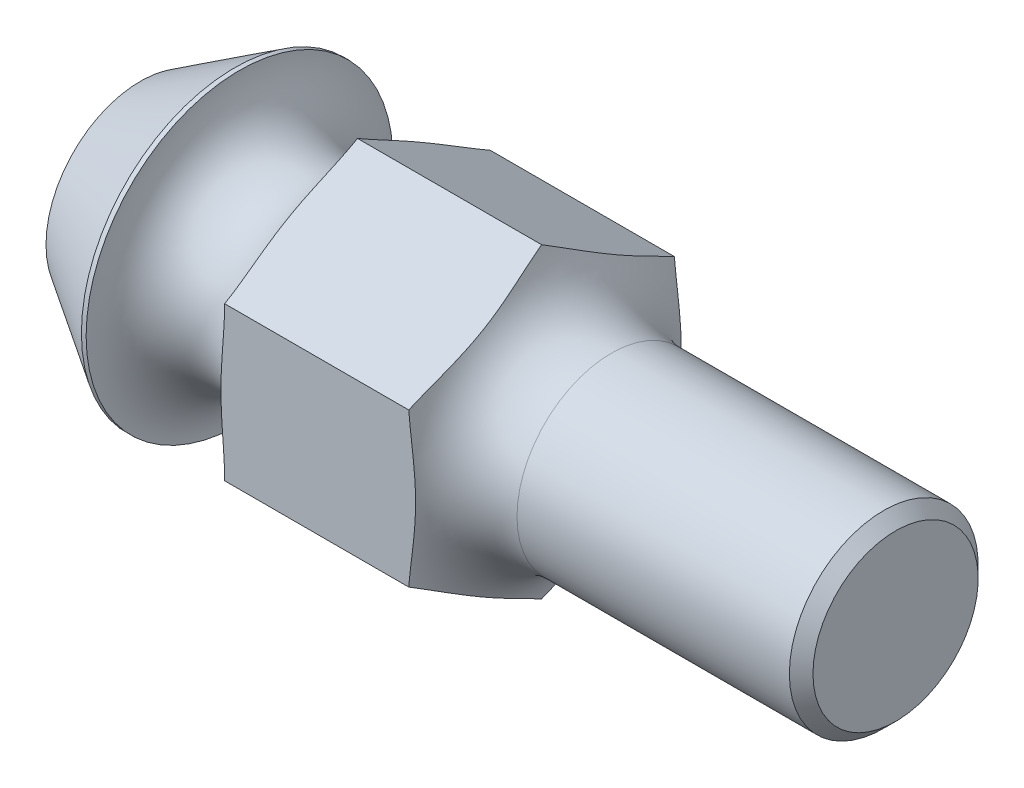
ISO-10303-21;
HEADER;
FILE_DESCRIPTION(('STEP AP214'),'2;1');
FILE_NAME('part.step','',(''),(''),'','','');
FILE_SCHEMA(('AUTOMOTIVE_DESIGN { 1 0 10303 214 1 1 1 1 }'));
ENDSEC;
DATA;
#1=APPLICATION_CONTEXT('core data for automotive mechanical design processes');
#2=APPLICATION_PROTOCOL_DEFINITION('international standard','automotive_design',2000,#1);
#3=PRODUCT_CONTEXT('',#1,'mechanical');
#4=PRODUCT('Part','Part','',(#3));
#5=PRODUCT_RELATED_PRODUCT_CATEGORY('part','',(#4));
#6=PRODUCT_DEFINITION_FORMATION('','',#4);
#7=PRODUCT_DEFINITION_CONTEXT('part definition',#1,'design');
#8=PRODUCT_DEFINITION('design','',#6,#7);
#9=PRODUCT_DEFINITION_SHAPE('','',#8);
#10=(LENGTH_UNIT() NAMED_UNIT(*) SI_UNIT(.MILLI.,.METRE.));
#11=(NAMED_UNIT(*) PLANE_ANGLE_UNIT() SI_UNIT($,.RADIAN.));
#12=(NAMED_UNIT(*) SI_UNIT($,.STERADIAN.) SOLID_ANGLE_UNIT());
#13=UNCERTAINTY_MEASURE_WITH_UNIT(LENGTH_MEASURE(1.E-05),#10,'distance_accuracy_value','');
#14=(GEOMETRIC_REPRESENTATION_CONTEXT(3) GLOBAL_UNCERTAINTY_ASSIGNED_CONTEXT((#13)) GLOBAL_UNIT_ASSIGNED_CONTEXT((#10,
#11,#12)) REPRESENTATION_CONTEXT('',''));
#15=CARTESIAN_POINT('',(0.,0.,0.));
#16=DIRECTION('',(0.,0.,1.));
#17=DIRECTION('',(1.,0.,0.));
#18=AXIS2_PLACEMENT_3D('',#15,#16,#17);
#19=CARTESIAN_POINT('',(32.,3.25,5.62916512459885));
#20=DIRECTION('',(0.,0.866025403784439,0.5));
#21=DIRECTION('',(0.,-0.5,0.866025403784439));
#22=AXIS2_PLACEMENT_3D('',#19,#20,#21);
#23=PLANE('',#22);
#24=DIRECTION('',(-1.,0.,0.));
#25=VECTOR('',#24,1.);
#26=CARTESIAN_POINT('',(32.,6.5,0.));
#27=LINE('',#26,#25);
#28=CARTESIAN_POINT('',(17.,6.5,0.));
#29=VERTEX_POINT('',#28);
#30=CARTESIAN_POINT('',(9.2,6.5,0.));
#31=VERTEX_POINT('',#30);
#32=EDGE_CURVE('E64',#29,#31,#27,.T.);
#33=ORIENTED_EDGE('',*,*,#32,.T.);
#34=CARTESIAN_POINT('',(9.19999999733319,6.50011547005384,-0.000199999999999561));
#35=CARTESIAN_POINT('',(9.19997270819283,6.39564752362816,0.180743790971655));
#36=CARTESIAN_POINT('',(9.19346405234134,6.29129966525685,0.361479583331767));
#37=CARTESIAN_POINT('',(9.17295866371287,6.08282039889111,0.722576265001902));
#38=CARTESIAN_POINT('',(9.15896542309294,5.97868891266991,0.902937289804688));
#39=CARTESIAN_POINT('',(9.12896893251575,5.7706159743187,1.26333019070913));
#40=CARTESIAN_POINT('',(9.11296752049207,5.66667443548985,1.44336221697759));
#41=CARTESIAN_POINT('',(9.08395514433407,5.45867312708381,1.80363105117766));
#42=CARTESIAN_POINT('',(9.07094406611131,5.35461336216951,1.9838678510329));
#43=CARTESIAN_POINT('',(9.05656178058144,5.19836071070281,2.25450538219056));
#44=CARTESIAN_POINT('',(9.05262286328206,5.14622855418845,2.34480092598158));
#45=CARTESIAN_POINT('',(9.04674415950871,5.04193666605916,2.5254397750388));
#46=CARTESIAN_POINT('',(9.04480432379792,4.98977693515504,2.61578307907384));
#47=CARTESIAN_POINT('',(9.04308236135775,4.88545084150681,2.79648117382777));
#48=CARTESIAN_POINT('',(9.04330012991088,4.83328447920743,2.88683596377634));
#49=CARTESIAN_POINT('',(9.04587401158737,4.72896513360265,3.06752237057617));
#50=CARTESIAN_POINT('',(9.04823013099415,4.67681215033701,3.15785398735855));
#51=CARTESIAN_POINT('',(9.05489585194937,4.57256298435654,3.33841883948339));
#52=CARTESIAN_POINT('',(9.05920452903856,4.52046678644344,3.42865210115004));
#53=CARTESIAN_POINT('',(9.0694362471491,4.41631345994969,3.60905095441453));
#54=CARTESIAN_POINT('',(9.0753593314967,4.36425633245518,3.69921654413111));
#55=CARTESIAN_POINT('',(9.0948891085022,4.20813148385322,3.9696327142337));
#56=CARTESIAN_POINT('',(9.11025544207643,4.10412134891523,4.1497835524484));
#57=CARTESIAN_POINT('',(9.13489176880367,3.93769778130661,4.43803762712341));
#58=CARTESIAN_POINT('',(9.14414244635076,3.87528217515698,4.54614462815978));
#59=CARTESIAN_POINT('',(9.16151853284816,3.75042149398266,4.76240967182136));
#60=CARTESIAN_POINT('',(9.16964414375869,3.68797642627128,4.87056770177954));
#61=CARTESIAN_POINT('',(9.18361281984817,3.56297722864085,5.0870726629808));
#62=CARTESIAN_POINT('',(9.18945444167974,3.50042305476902,5.1954196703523));
#63=CARTESIAN_POINT('',(9.1976492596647,3.37521395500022,5.41228819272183));
#64=CARTESIAN_POINT('',(9.19999986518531,3.31255898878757,5.52080977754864));
#65=CARTESIAN_POINT('',(9.19999999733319,3.24988452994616,5.62936512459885));
#66=B_SPLINE_CURVE_WITH_KNOTS('',3,(#34,#35,#36,#37,#38,#39,#40,#41,#42,#43,#44,#45,#46,#47,#48,
#49,#50,#51,#52,#53,#54,#55,#56,#57,#58,#59,#60,#61,#62,#63,#64,#65),.UNSPECIFIED.,.F.,.F.,(4,2,
2,2,2,2,2,2,2,2,2,2,2,2,2,4),(0.,0.626384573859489,1.25247714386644,1.87800081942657,
2.50350062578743,2.81649966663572,3.12949099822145,3.44246713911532,3.755444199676,
4.06827323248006,4.38111066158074,5.00685186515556,5.38237351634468,5.75782767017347,
6.13351870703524,6.50948839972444),.UNSPECIFIED.);
#67=CARTESIAN_POINT('',(9.2,3.25000000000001,5.62916512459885));
#68=VERTEX_POINT('',#67);
#69=EDGE_CURVE('E57',#31,#68,#66,.T.);
#70=ORIENTED_EDGE('',*,*,#69,.T.);
#71=DIRECTION('',(-1.,0.,0.));
#72=VECTOR('',#71,1.);
#73=CARTESIAN_POINT('',(32.,3.25,5.62916512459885));
#74=LINE('',#73,#72);
#75=CARTESIAN_POINT('',(17.,3.25,5.62916512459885));
#76=VERTEX_POINT('',#75);
#77=EDGE_CURVE('E104',#76,#68,#74,.T.);
#78=ORIENTED_EDGE('',*,*,#77,.F.);
#79=CARTESIAN_POINT('',(16.9999804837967,3.24988452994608,5.62936512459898));
#80=CARTESIAN_POINT('',(17.0114551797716,3.3178328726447,5.51167514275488));
#81=CARTESIAN_POINT('',(17.024798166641,3.38568710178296,5.39414817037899));
#82=CARTESIAN_POINT('',(17.0538521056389,3.521256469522,5.15933513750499));
#83=CARTESIAN_POINT('',(17.0695625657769,3.58897163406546,5.04204903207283));
#84=CARTESIAN_POINT('',(17.1183324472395,3.79256977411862,4.68940670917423));
#85=CARTESIAN_POINT('',(17.1529159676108,3.92835904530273,4.4542127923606));
#86=CARTESIAN_POINT('',(17.199261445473,4.13174169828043,4.10194370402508));
#87=CARTESIAN_POINT('',(17.2137338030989,4.19917381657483,3.98514784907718));
#88=CARTESIAN_POINT('',(17.2396465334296,4.33418488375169,3.75130182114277));
#89=CARTESIAN_POINT('',(17.2510870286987,4.40176382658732,3.63425165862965));
#90=CARTESIAN_POINT('',(17.269845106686,4.53690814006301,3.40017484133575));
#91=CARTESIAN_POINT('',(17.2771724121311,4.60447316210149,3.28314879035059));
#92=CARTESIAN_POINT('',(17.2870272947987,4.73969212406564,3.04894267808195));
#93=CARTESIAN_POINT('',(17.2895549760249,4.8073460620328,2.93176262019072));
#94=CARTESIAN_POINT('',(17.2895549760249,4.94265393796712,2.69740250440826));
#95=CARTESIAN_POINT('',(17.2870272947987,5.01030787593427,2.58022244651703));
#96=CARTESIAN_POINT('',(17.2771724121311,5.14552683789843,2.34601633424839));
#97=CARTESIAN_POINT('',(17.269845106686,5.21309185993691,2.22899028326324));
#98=CARTESIAN_POINT('',(17.2510870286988,5.3482361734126,1.99491346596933));
#99=CARTESIAN_POINT('',(17.2396465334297,5.41581511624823,1.87786330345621));
#100=CARTESIAN_POINT('',(17.2137338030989,5.55082618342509,1.6440172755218));
#101=CARTESIAN_POINT('',(17.199261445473,5.61825830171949,1.5272214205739));
#102=CARTESIAN_POINT('',(17.1529159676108,5.82164095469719,1.17495233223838));
#103=CARTESIAN_POINT('',(17.1183324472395,5.9574302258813,0.93975841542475));
#104=CARTESIAN_POINT('',(17.069562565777,6.16102836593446,0.58711609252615));
#105=CARTESIAN_POINT('',(17.0538521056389,6.22874353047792,0.469829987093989));
#106=CARTESIAN_POINT('',(17.024798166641,6.36431289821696,0.235016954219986));
#107=CARTESIAN_POINT('',(17.0114551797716,6.43216712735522,0.117489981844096));
#108=CARTESIAN_POINT('',(16.9999804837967,6.50011547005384,-0.000200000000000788));
#109=B_SPLINE_CURVE_WITH_KNOTS('',3,(#79,#80,#81,#82,#83,#84,#85,#86,#87,#88,#89,#90,#91,#92,
#93,#94,#95,#96,#97,#98,#99,#100,#101,#102,#103,#104,#105,#106,#107,#108),.UNSPECIFIED.,.F.,.F.,
(4,2,2,2,2,2,2,2,2,2,2,2,2,2,4),(0.,0.40908515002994,0.818085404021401,1.63938135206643,
2.04627418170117,2.45315056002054,2.85906107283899,3.26496278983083,3.67086450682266,
4.07677501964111,4.48365139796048,4.89054422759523,5.71184017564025,6.12084042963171,
6.52992557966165),.UNSPECIFIED.);
#110=EDGE_CURVE('E13',#76,#29,#109,.T.);
#111=ORIENTED_EDGE('',*,*,#110,.T.);
#112=EDGE_LOOP('',(#33,#70,#78,#111));
#113=FACE_BOUND('',#112,.T.);
#114=ADVANCED_FACE('F38',(#113),#23,.T.);
#115=CARTESIAN_POINT('',(32.,-3.25,5.62916512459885));
#116=DIRECTION('',(0.,0.,1.));
#117=DIRECTION('',(0.,-1.,0.));
#118=AXIS2_PLACEMENT_3D('',#115,#116,#117);
#119=PLANE('',#118);
#120=ORIENTED_EDGE('',*,*,#77,.T.);
#121=CARTESIAN_POINT('',(9.04342625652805,0.,5.62916512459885));
#122=CARTESIAN_POINT('',(9.04342371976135,-0.1041875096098,5.62916512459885));
#123=CARTESIAN_POINT('',(9.04450759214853,-0.208373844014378,5.62916512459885));
#124=CARTESIAN_POINT('',(9.04875239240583,-0.416730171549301,5.62916512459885));
#125=CARTESIAN_POINT('',(9.05191384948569,-0.520900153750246,5.62916512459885));
#126=CARTESIAN_POINT('',(9.06007567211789,-0.729277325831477,5.62916512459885));
#127=CARTESIAN_POINT('',(9.06507799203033,-0.833484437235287,5.62916512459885));
#128=CARTESIAN_POINT('',(9.07652941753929,-1.04180472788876,5.62916512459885));
#129=CARTESIAN_POINT('',(9.08297836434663,-1.14591791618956,5.62916512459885));
#130=CARTESIAN_POINT('',(9.1024056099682,-1.43774202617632,5.62916512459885));
#131=CARTESIAN_POINT('',(9.11646561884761,-1.62538284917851,5.62916512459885));
#132=CARTESIAN_POINT('',(9.14420314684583,-2.00068992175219,5.62916512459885));
#133=CARTESIAN_POINT('',(9.1578805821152,-2.18835616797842,5.62916512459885));
#134=CARTESIAN_POINT('',(9.19248463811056,-2.75190337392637,5.62916512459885));
#135=CARTESIAN_POINT('',(9.20699726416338,-3.12846543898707,5.62916512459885));
#136=CARTESIAN_POINT('',(9.18905575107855,-3.77548069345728,5.62916512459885));
#137=CARTESIAN_POINT('',(9.16862552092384,-4.04609218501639,5.62916512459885));
#138=CARTESIAN_POINT('',(9.08912843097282,-4.5817871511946,5.62916512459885));
#139=CARTESIAN_POINT('',(9.03015661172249,-4.84688257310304,5.62916512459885));
#140=CARTESIAN_POINT('',(8.89179644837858,-5.26806732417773,5.62916512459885));
#141=CARTESIAN_POINT('',(8.82741146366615,-5.42902859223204,5.62916512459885));
#142=CARTESIAN_POINT('',(8.67502003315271,-5.73952820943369,5.62916512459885));
#143=CARTESIAN_POINT('',(8.58703472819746,-5.88907662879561,5.62916512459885));
#144=CARTESIAN_POINT('',(8.40477990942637,-6.14377600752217,5.62916512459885));
#145=CARTESIAN_POINT('',(8.31480863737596,-6.25198592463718,5.62916512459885));
#146=CARTESIAN_POINT('',(8.11834176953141,-6.45226338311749,5.62916512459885));
#147=CARTESIAN_POINT('',(8.01186388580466,-6.5443480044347,5.62916512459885));
#148=CARTESIAN_POINT('',(7.80107601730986,-6.69534461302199,5.62916512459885));
#149=CARTESIAN_POINT('',(7.69885377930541,-6.75716375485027,5.62916512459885));
#150=CARTESIAN_POINT('',(7.48548501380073,-6.86290503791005,5.62916512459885));
#151=CARTESIAN_POINT('',(7.37434155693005,-6.90683330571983,5.62916512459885));
#152=CARTESIAN_POINT('',(7.14553499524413,-6.97456445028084,5.62916512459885));
#153=CARTESIAN_POINT('',(7.02784705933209,-6.99828418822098,5.62916512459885));
#154=CARTESIAN_POINT('',(6.79011642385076,-7.02385214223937,5.62916512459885));
#155=CARTESIAN_POINT('',(6.67007433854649,-7.02570598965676,5.62916512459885));
#156=CARTESIAN_POINT('',(6.44051204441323,-7.00812995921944,5.62916512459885));
#157=CARTESIAN_POINT('',(6.33086845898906,-6.99025878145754,5.62916512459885));
#158=CARTESIAN_POINT('',(6.11607401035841,-6.93662898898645,5.62916512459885));
#159=CARTESIAN_POINT('',(6.01092325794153,-6.90086993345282,5.62916512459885));
#160=CARTESIAN_POINT('',(5.80598216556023,-6.81246996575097,5.62916512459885));
#161=CARTESIAN_POINT('',(5.70630769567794,-6.75956238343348,5.62916512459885));
#162=CARTESIAN_POINT('',(5.51611439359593,-6.63938195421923,5.62916512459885));
#163=CARTESIAN_POINT('',(5.42559616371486,-6.57210816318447,5.62916512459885));
#164=CARTESIAN_POINT('',(5.24529587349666,-6.41749178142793,5.62916512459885));
#165=CARTESIAN_POINT('',(5.15672011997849,-6.32874815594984,5.62916512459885));
#166=CARTESIAN_POINT('',(4.99275439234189,-6.1397659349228,5.62916512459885));
#167=CARTESIAN_POINT('',(4.91738229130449,-6.03951205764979,5.62916512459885));
#168=CARTESIAN_POINT('',(4.74134936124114,-5.77209627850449,5.62916512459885));
#169=CARTESIAN_POINT('',(4.65000618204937,-5.59878504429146,5.62916512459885));
#170=CARTESIAN_POINT('',(4.49632912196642,-5.24022332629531,5.62916512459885));
#171=CARTESIAN_POINT('',(4.43399560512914,-5.05497269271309,5.62916512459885));
#172=CARTESIAN_POINT('',(4.34284618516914,-4.71199599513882,5.62916512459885));
#173=CARTESIAN_POINT('',(4.31002442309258,-4.55529058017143,5.62916512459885));
#174=CARTESIAN_POINT('',(4.25827469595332,-4.23956395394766,5.62916512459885));
#175=CARTESIAN_POINT('',(4.23935579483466,-4.0805413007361,5.62916512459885));
#176=CARTESIAN_POINT('',(4.21273999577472,-3.76072337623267,5.62916512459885));
#177=CARTESIAN_POINT('',(4.20510709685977,-3.59992316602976,5.62916512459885));
#178=CARTESIAN_POINT('',(4.19862364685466,-3.27817913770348,5.62916512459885));
#179=CARTESIAN_POINT('',(4.19977376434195,-3.11723530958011,5.62916512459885));
#180=CARTESIAN_POINT('',(4.21026997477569,-2.71965030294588,5.62916512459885));
#181=CARTESIAN_POINT('',(4.2232274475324,-2.48312611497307,5.62916512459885));
#182=CARTESIAN_POINT('',(4.25447500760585,-2.01036507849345,5.62916512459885));
#183=CARTESIAN_POINT('',(4.27276826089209,-1.77412848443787,5.62916512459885));
#184=CARTESIAN_POINT('',(4.2985231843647,-1.41981288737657,5.62916512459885));
#185=CARTESIAN_POINT('',(4.30682184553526,-1.30180104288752,5.62916512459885));
#186=CARTESIAN_POINT('',(4.32204892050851,-1.06569043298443,5.62916512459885));
#187=CARTESIAN_POINT('',(4.32897737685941,-0.947591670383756,5.62916512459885));
#188=CARTESIAN_POINT('',(4.34077163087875,-0.711357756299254,5.62916512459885));
#189=CARTESIAN_POINT('',(4.34563865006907,-0.593222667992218,5.62916512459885));
#190=CARTESIAN_POINT('',(4.35283150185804,-0.3568740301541,5.62916512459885));
#191=CARTESIAN_POINT('',(4.35515736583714,-0.238660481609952,5.62916512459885));
#192=CARTESIAN_POINT('',(4.35703386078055,-0.00216664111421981,5.62916512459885));
#193=CARTESIAN_POINT('',(4.35658345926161,0.116113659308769,5.62916512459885));
#194=CARTESIAN_POINT('',(4.35295091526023,0.35263182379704,5.62916512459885));
#195=CARTESIAN_POINT('',(4.3497687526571,0.470869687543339,5.62916512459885));
#196=CARTESIAN_POINT('',(4.34098879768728,0.707314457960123,5.62916512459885));
#197=CARTESIAN_POINT('',(4.33538973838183,0.825521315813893,5.62916512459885));
#198=CARTESIAN_POINT('',(4.32233801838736,1.06183146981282,5.62916512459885));
#199=CARTESIAN_POINT('',(4.31488533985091,1.17993476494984,5.62916512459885));
#200=CARTESIAN_POINT('',(4.2907979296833,1.53454191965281,5.62916512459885));
#201=CARTESIAN_POINT('',(4.27245441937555,1.7709195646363,5.62916512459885));
#202=CARTESIAN_POINT('',(4.23845035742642,2.24381045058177,5.62916512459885));
#203=CARTESIAN_POINT('',(4.22278874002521,2.48032360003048,5.62916512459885));
#204=CARTESIAN_POINT('',(4.2052349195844,2.88312261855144,5.62916512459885));
#205=CARTESIAN_POINT('',(4.20062644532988,3.04927193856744,5.62916512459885));
#206=CARTESIAN_POINT('',(4.199492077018,3.38159786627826,5.62916512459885));
#207=CARTESIAN_POINT('',(4.20296401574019,3.54777445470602,5.62916512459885));
#208=CARTESIAN_POINT('',(4.22081922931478,3.87865710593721,5.62916512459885));
#209=CARTESIAN_POINT('',(4.23514017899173,4.04336615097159,5.62916512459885));
#210=CARTESIAN_POINT('',(4.27749358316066,4.37098867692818,5.62916512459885));
#211=CARTESIAN_POINT('',(4.30551786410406,4.53390316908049,5.62916512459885));
#212=CARTESIAN_POINT('',(4.38257112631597,4.87564650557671,5.62916512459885));
#213=CARTESIAN_POINT('',(4.43373231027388,5.0540142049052,5.62916512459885));
#214=CARTESIAN_POINT('',(4.56096522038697,5.40226514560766,5.62916512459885));
#215=CARTESIAN_POINT('',(4.63707507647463,5.57213493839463,5.62916512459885));
#216=CARTESIAN_POINT('',(4.8014201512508,5.8680272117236,5.62916512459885));
#217=CARTESIAN_POINT('',(4.88518042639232,5.99651174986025,5.62916512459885));
#218=CARTESIAN_POINT('',(5.07247532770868,6.23806367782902,5.62916512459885));
#219=CARTESIAN_POINT('',(5.17596888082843,6.3511622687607,5.62916512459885));
#220=CARTESIAN_POINT('',(5.38124541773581,6.53740031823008,5.62916512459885));
#221=CARTESIAN_POINT('',(5.47982379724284,6.61406246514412,5.62916512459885));
#222=CARTESIAN_POINT('',(5.68838961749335,6.75007817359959,5.62916512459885));
#223=CARTESIAN_POINT('',(5.79837586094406,6.80943354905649,5.62916512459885));
#224=CARTESIAN_POINT('',(6.02787088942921,6.90792673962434,5.62916512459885));
#225=CARTESIAN_POINT('',(6.14742957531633,6.94694941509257,5.62916512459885));
#226=CARTESIAN_POINT('',(6.39175643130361,7.00181059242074,5.62916512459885));
#227=CARTESIAN_POINT('',(6.5165217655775,7.01766154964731,5.62916512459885));
#228=CARTESIAN_POINT('',(6.75421654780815,7.02478801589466,5.62916512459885));
#229=CARTESIAN_POINT('',(6.86708267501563,7.0183613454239,5.62916512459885));
#230=CARTESIAN_POINT('',(7.09002320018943,6.9862864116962,5.62916512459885));
#231=CARTESIAN_POINT('',(7.20009800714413,6.96064098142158,5.62916512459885));
#232=CARTESIAN_POINT('',(7.41268852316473,6.89204756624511,5.62916512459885));
#233=CARTESIAN_POINT('',(7.5152978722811,6.84938693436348,5.62916512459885));
#234=CARTESIAN_POINT('',(7.71265922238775,6.7487518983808,5.62916512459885));
#235=CARTESIAN_POINT('',(7.80740997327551,6.69077506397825,5.62916512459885));
#236=CARTESIAN_POINT('',(7.99520153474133,6.55631880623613,5.62916512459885));
#237=CARTESIAN_POINT('',(8.08741264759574,6.47868565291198,5.62916512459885));
#238=CARTESIAN_POINT('',(8.25982123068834,6.31110522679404,5.62916512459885));
#239=CARTESIAN_POINT('',(8.34001026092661,6.22114938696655,5.62916512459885));
#240=CARTESIAN_POINT('',(8.52419891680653,5.98553138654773,5.62916512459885));
#241=CARTESIAN_POINT('',(8.62079617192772,5.83406310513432,5.62916512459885));
#242=CARTESIAN_POINT('',(8.78828488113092,5.51765325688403,5.62916512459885));
#243=CARTESIAN_POINT('',(8.85913257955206,5.35268933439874,5.62916512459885));
#244=CARTESIAN_POINT('',(9.00926506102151,4.92595220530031,5.62916512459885));
#245=CARTESIAN_POINT('',(9.07340526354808,4.65887639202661,5.62916512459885));
#246=CARTESIAN_POINT('',(9.13917512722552,4.2538124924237,5.62916512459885));
#247=CARTESIAN_POINT('',(9.15602785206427,4.11779037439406,5.62916512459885));
#248=CARTESIAN_POINT('',(9.18121579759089,3.84498614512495,5.62916512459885));
#249=CARTESIAN_POINT('',(9.1895552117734,3.70820444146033,5.62916512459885));
#250=CARTESIAN_POINT('',(9.2050992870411,3.27363055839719,5.62916512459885));
#251=CARTESIAN_POINT('',(9.19946131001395,2.97546203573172,5.62916512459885));
#252=CARTESIAN_POINT('',(9.17205689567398,2.37972318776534,5.62916512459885));
#253=CARTESIAN_POINT('',(9.15026143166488,2.08215490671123,5.62916512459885));
#254=CARTESIAN_POINT('',(9.11722844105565,1.6359983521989,5.62916512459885));
#255=CARTESIAN_POINT('',(9.10616748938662,1.4874004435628,5.62916512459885));
#256=CARTESIAN_POINT('',(9.08567695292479,1.19008746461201,5.62916512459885));
#257=CARTESIAN_POINT('',(9.07624735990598,1.0413723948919,5.62916512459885));
#258=CARTESIAN_POINT('',(9.06050445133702,0.743938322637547,5.62916512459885));
#259=CARTESIAN_POINT('',(9.0541876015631,0.595219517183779,5.62916512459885));
#260=CARTESIAN_POINT('',(9.04565044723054,0.297666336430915,5.62916512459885));
#261=CARTESIAN_POINT('',(9.04342988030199,0.14883196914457,5.62916512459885));
#262=CARTESIAN_POINT('',(9.04342625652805,0.,5.62916512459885));
#263=B_SPLINE_CURVE_WITH_KNOTS('',3,(#121,#122,#123,#124,#125,#126,#127,#128,#129,#130,#131,
#132,#133,#134,#135,#136,#137,#138,#139,#140,#141,#142,#143,#144,#145,#146,#147,#148,#149,#150,
#151,#152,#153,#154,#155,#156,#157,#158,#159,#160,#161,#162,#163,#164,#165,#166,#167,#168,#169,
#170,#171,#172,#173,#174,#175,#176,#177,#178,#179,#180,#181,#182,#183,#184,#185,#186,#187,#188,
#189,#190,#191,#192,#193,#194,#195,#196,#197,#198,#199,#200,#201,#202,#203,#204,#205,#206,#207,
#208,#209,#210,#211,#212,#213,#214,#215,#216,#217,#218,#219,#220,#221,#222,#223,#224,#225,#226,
#227,#228,#229,#230,#231,#232,#233,#234,#235,#236,#237,#238,#239,#240,#241,#242,#243,#244,#245,
#246,#247,#248,#249,#250,#251,#252,#253,#254,#255,#256,#257,#258,#259,#260,#261,#262),
.UNSPECIFIED.,.T.,.F.,(4,2,2,2,2,2,2,2,2,2,2,2,2,2,2,2,2,2,2,2,2,2,2,2,2,2,2,2,2,2,2,2,2,2,2,2,
2,2,2,2,2,2,2,2,2,2,2,2,2,2,2,2,2,2,2,2,2,2,2,2,2,2,2,2,2,2,2,2,2,2,4),(0.,0.31255515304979,
0.625189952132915,0.938157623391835,1.25109095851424,1.8155563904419,2.38014458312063,
3.50892047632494,4.321319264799,5.13172226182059,5.65024277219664,6.16830034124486,
6.58887024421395,7.00899194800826,7.36585350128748,7.72259274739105,8.0807926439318,
8.43890028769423,8.77061268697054,9.10233326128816,9.43948192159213,9.77665274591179,
10.1514000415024,10.526650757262,11.1110398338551,11.6954362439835,12.1750462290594,
12.654968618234,13.1376021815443,13.6202724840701,14.3307025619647,15.0415550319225,
15.3964594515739,15.7513528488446,16.106035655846,16.4607140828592,16.815524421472,
17.1703373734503,17.5253365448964,17.8803391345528,18.5916158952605,19.3026093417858,
19.8011157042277,20.2994883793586,20.7950195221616,21.2902554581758,21.8454475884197,
22.4014922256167,22.8599118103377,23.3173874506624,23.6904932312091,24.0635598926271,
24.4387167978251,24.8136719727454,25.1511529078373,25.4885841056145,25.8205429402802,
26.1525544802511,26.5127828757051,26.8732629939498,27.409162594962,27.9459686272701,
28.7649772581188,29.1760251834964,29.5868705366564,30.4803739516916,31.3754864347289,
31.8225113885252,32.2695340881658,32.7160480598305,33.1625334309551),.UNSPECIFIED.);
#264=CARTESIAN_POINT('',(9.2,-3.25,5.62916512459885));
#265=VERTEX_POINT('',#264);
#266=EDGE_CURVE('E92',#68,#265,#263,.T.);
#267=ORIENTED_EDGE('',*,*,#266,.T.);
#268=DIRECTION('',(-1.,0.,0.));
#269=VECTOR('',#268,1.);
#270=CARTESIAN_POINT('',(32.,-3.25,5.62916512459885));
#271=LINE('',#270,#269);
#272=CARTESIAN_POINT('',(16.9999999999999,-3.25,5.62916512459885));
#273=VERTEX_POINT('',#272);
#274=EDGE_CURVE('E110',#273,#265,#271,.T.);
#275=ORIENTED_EDGE('',*,*,#274,.F.);
#276=CARTESIAN_POINT('',(17.2895549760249,0.,5.62916512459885));
#277=CARTESIAN_POINT('',(17.2895536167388,0.126941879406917,5.62916512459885));
#278=CARTESIAN_POINT('',(17.2873320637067,0.253885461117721,5.62916512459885));
#279=CARTESIAN_POINT('',(17.2786408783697,0.507625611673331,5.62916512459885));
#280=CARTESIAN_POINT('',(17.2721711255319,0.634422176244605,5.62916512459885));
#281=CARTESIAN_POINT('',(17.2555404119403,0.887845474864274,5.62916512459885));
#282=CARTESIAN_POINT('',(17.2453771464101,1.01447205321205,5.62916512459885));
#283=CARTESIAN_POINT('',(17.222201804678,1.26746797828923,5.62916512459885));
#284=CARTESIAN_POINT('',(17.209189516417,1.39383730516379,5.62916512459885));
#285=CARTESIAN_POINT('',(17.1670483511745,1.77575370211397,5.62916512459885));
#286=CARTESIAN_POINT('',(17.1350686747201,2.03096986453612,5.62916512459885));
#287=CARTESIAN_POINT('',(17.0728679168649,2.54155375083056,5.62916512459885));
#288=CARTESIAN_POINT('',(17.0426463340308,2.79692141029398,5.62916512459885));
#289=CARTESIAN_POINT('',(16.9938717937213,3.30133246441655,5.62916512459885));
#290=CARTESIAN_POINT('',(16.9750027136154,3.55034177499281,5.62916512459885));
#291=CARTESIAN_POINT('',(16.9555623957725,4.04945081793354,5.62916512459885));
#292=CARTESIAN_POINT('',(16.9550038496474,4.29955118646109,5.62916512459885));
#293=CARTESIAN_POINT('',(16.9797424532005,4.795251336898,5.62916512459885));
#294=CARTESIAN_POINT('',(17.0046862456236,5.04086590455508,5.62916512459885));
#295=CARTESIAN_POINT('',(17.0869517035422,5.5264431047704,5.62916512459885));
#296=CARTESIAN_POINT('',(17.1441832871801,5.76641953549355,5.62916512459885));
#297=CARTESIAN_POINT('',(17.2478512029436,6.0835264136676,5.62916512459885));
#298=CARTESIAN_POINT('',(17.2776036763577,6.16623496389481,5.62916512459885));
#299=CARTESIAN_POINT('',(17.3422670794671,6.32972830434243,5.62916512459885));
#300=CARTESIAN_POINT('',(17.3771843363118,6.41051059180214,5.62916512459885));
#301=CARTESIAN_POINT('',(17.4903679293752,6.64996594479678,5.62916512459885));
#302=CARTESIAN_POINT('',(17.5768019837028,6.80491599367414,5.62916512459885));
#303=CARTESIAN_POINT('',(17.7726679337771,7.10070728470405,5.62916512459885));
#304=CARTESIAN_POINT('',(17.8822061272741,7.24147871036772,5.62916512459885));
#305=CARTESIAN_POINT('',(18.1234737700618,7.50226821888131,5.62916512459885));
#306=CARTESIAN_POINT('',(18.2551536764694,7.62233144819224,5.62916512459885));
#307=CARTESIAN_POINT('',(18.5164596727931,7.81934974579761,5.62916512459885));
#308=CARTESIAN_POINT('',(18.6432184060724,7.90010536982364,5.62916512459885));
#309=CARTESIAN_POINT('',(18.9085165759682,8.03935160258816,5.62916512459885));
#310=CARTESIAN_POINT('',(19.0470547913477,8.09784451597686,5.62916512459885));
#311=CARTESIAN_POINT('',(19.3327564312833,8.18986825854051,5.62916512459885));
#312=CARTESIAN_POINT('',(19.479947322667,8.22331438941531,5.62916512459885));
#313=CARTESIAN_POINT('',(19.777947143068,8.26313199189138,5.62916512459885));
#314=CARTESIAN_POINT('',(19.9287551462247,8.26951031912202,5.62916512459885));
#315=CARTESIAN_POINT('',(20.2194581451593,8.25533849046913,5.62916512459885));
#316=CARTESIAN_POINT('',(20.3594384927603,8.2364710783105,5.62916512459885));
#317=CARTESIAN_POINT('',(20.6342646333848,8.17562451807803,5.62916512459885));
#318=CARTESIAN_POINT('',(20.7691101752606,8.13364424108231,5.62916512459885));
#319=CARTESIAN_POINT('',(21.0310907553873,8.02810164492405,5.62916512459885));
#320=CARTESIAN_POINT('',(21.1581667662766,7.9643937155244,5.62916512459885));
#321=CARTESIAN_POINT('',(21.4008372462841,7.81814191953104,5.62916512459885));
#322=CARTESIAN_POINT('',(21.5164345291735,7.73560268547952,5.62916512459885));
#323=CARTESIAN_POINT('',(21.7433843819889,7.54717510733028,5.62916512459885));
#324=CARTESIAN_POINT('',(21.8536001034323,7.4399222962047,5.62916512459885));
#325=CARTESIAN_POINT('',(22.0574914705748,7.21048632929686,5.62916512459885));
#326=CARTESIAN_POINT('',(22.1511331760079,7.08827338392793,5.62916512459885));
#327=CARTESIAN_POINT('',(22.3588341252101,6.77643742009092,5.62916512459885));
#328=CARTESIAN_POINT('',(22.4638297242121,6.58076161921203,5.62916512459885));
#329=CARTESIAN_POINT('',(22.6402292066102,6.17580581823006,5.62916512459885));
#330=CARTESIAN_POINT('',(22.7117129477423,5.96655952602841,5.62916512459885));
#331=CARTESIAN_POINT('',(22.8111448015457,5.59397905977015,5.62916512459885));
#332=CARTESIAN_POINT('',(22.8455143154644,5.43228447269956,5.62916512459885));
#333=CARTESIAN_POINT('',(22.8998013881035,5.10648064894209,5.62916512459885));
#334=CARTESIAN_POINT('',(22.9197146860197,4.94237071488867,5.62916512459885));
#335=CARTESIAN_POINT('',(22.9472805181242,4.61178414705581,5.62916512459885));
#336=CARTESIAN_POINT('',(22.9548282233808,4.44529922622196,5.62916512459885));
#337=CARTESIAN_POINT('',(22.9583950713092,4.19546491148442,5.62916512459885));
#338=CARTESIAN_POINT('',(22.9582902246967,4.11214087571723,5.62916512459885));
#339=CARTESIAN_POINT('',(22.9557801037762,3.94555676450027,5.62916512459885));
#340=CARTESIAN_POINT('',(22.9533756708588,3.86229667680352,5.62916512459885));
#341=CARTESIAN_POINT('',(22.9424457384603,3.59559399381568,5.62916512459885));
#342=CARTESIAN_POINT('',(22.9300357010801,3.41231164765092,5.62916512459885));
#343=CARTESIAN_POINT('',(22.8985977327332,3.04630614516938,5.62916512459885));
#344=CARTESIAN_POINT('',(22.8795675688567,2.8635831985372,5.62916512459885));
#345=CARTESIAN_POINT('',(22.8381324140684,2.49817303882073,5.62916512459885));
#346=CARTESIAN_POINT('',(22.8157208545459,2.31548660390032,5.62916512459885));
#347=CARTESIAN_POINT('',(22.7709637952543,1.95011808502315,5.62916512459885));
#348=CARTESIAN_POINT('',(22.7486182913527,1.76743600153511,5.62916512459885));
#349=CARTESIAN_POINT('',(22.7074141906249,1.40176529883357,5.62916512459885));
#350=CARTESIAN_POINT('',(22.6885535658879,1.21877692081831,5.62916512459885));
#351=CARTESIAN_POINT('',(22.6573852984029,0.852235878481,5.62916512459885));
#352=CARTESIAN_POINT('',(22.6450767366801,0.668683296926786,5.62916512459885));
#353=CARTESIAN_POINT('',(22.6292106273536,0.301691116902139,5.62916512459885));
#354=CARTESIAN_POINT('',(22.6256286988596,0.118252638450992,5.62916512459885));
#355=CARTESIAN_POINT('',(22.6278082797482,-0.248568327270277,5.62916512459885));
#356=CARTESIAN_POINT('',(22.6335699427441,-0.431950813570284,5.62916512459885));
#357=CARTESIAN_POINT('',(22.6532345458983,-0.795622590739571,5.62916512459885));
#358=CARTESIAN_POINT('',(22.6670199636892,-0.975918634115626,5.62916512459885));
#359=CARTESIAN_POINT('',(22.7003183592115,-1.33597786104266,5.62916512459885));
#360=CARTESIAN_POINT('',(22.7198321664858,-1.51574096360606,5.62916512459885));
#361=CARTESIAN_POINT('',(22.7616389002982,-1.87561873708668,5.62916512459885));
#362=CARTESIAN_POINT('',(22.7839420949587,-2.05573215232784,5.62916512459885));
#363=CARTESIAN_POINT('',(22.8279803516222,-2.41601840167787,5.62916512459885));
#364=CARTESIAN_POINT('',(22.84971545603,-2.59619123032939,5.62916512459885));
#365=CARTESIAN_POINT('',(22.8892717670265,-2.95613523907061,5.62916512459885));
#366=CARTESIAN_POINT('',(22.9071108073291,-3.13590435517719,5.62916512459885));
#367=CARTESIAN_POINT('',(22.9358966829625,-3.4959839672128,5.62916512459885));
#368=CARTESIAN_POINT('',(22.9468454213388,-3.67629429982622,5.62916512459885));
#369=CARTESIAN_POINT('',(22.9588383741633,-4.036633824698,5.62916512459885));
#370=CARTESIAN_POINT('',(22.9599185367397,-4.21666164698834,5.62916512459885));
#371=CARTESIAN_POINT('',(22.9493801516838,-4.5763096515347,5.62916512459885));
#372=CARTESIAN_POINT('',(22.9377703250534,-4.75593002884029,5.62916512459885));
#373=CARTESIAN_POINT('',(22.9049742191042,-5.05904343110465,5.62916512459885));
#374=CARTESIAN_POINT('',(22.8877822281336,-5.18296705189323,5.62916512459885));
#375=CARTESIAN_POINT('',(22.8449799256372,-5.42960618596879,5.62916512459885));
#376=CARTESIAN_POINT('',(22.8193546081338,-5.5523191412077,5.62916512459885));
#377=CARTESIAN_POINT('',(22.7590055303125,-5.79479454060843,5.62916512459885));
#378=CARTESIAN_POINT('',(22.7243331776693,-5.91456960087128,5.62916512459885));
#379=CARTESIAN_POINT('',(22.6451173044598,-6.15070748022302,5.62916512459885));
#380=CARTESIAN_POINT('',(22.6005814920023,-6.26707288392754,5.62916512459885));
#381=CARTESIAN_POINT('',(22.4741450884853,-6.5566905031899,5.62916512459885));
#382=CARTESIAN_POINT('',(22.3850286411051,-6.72689395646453,5.62916512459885));
#383=CARTESIAN_POINT('',(22.1801887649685,-7.05115421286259,5.62916512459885));
#384=CARTESIAN_POINT('',(22.0644188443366,-7.20518210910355,5.62916512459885));
#385=CARTESIAN_POINT('',(21.8277276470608,-7.46656774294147,5.62916512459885));
#386=CARTESIAN_POINT('',(21.7107041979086,-7.57744178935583,5.62916512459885));
#387=CARTESIAN_POINT('',(21.4599454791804,-7.77817368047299,5.62916512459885));
#388=CARTESIAN_POINT('',(21.3262335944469,-7.86806043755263,5.62916512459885));
#389=CARTESIAN_POINT('',(21.0440370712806,-8.02314249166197,5.62916512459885));
#390=CARTESIAN_POINT('',(20.8954694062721,-8.08818796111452,5.62916512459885));
#391=CARTESIAN_POINT('',(20.5886642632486,-8.18917564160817,5.62916512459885));
#392=CARTESIAN_POINT('',(20.430427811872,-8.22512093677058,5.62916512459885));
#393=CARTESIAN_POINT('',(20.1263520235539,-8.26365740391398,5.62916512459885));
#394=CARTESIAN_POINT('',(19.9808900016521,-8.26927085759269,5.62916512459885));
#395=CARTESIAN_POINT('',(19.6912669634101,-8.25500264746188,5.62916512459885));
#396=CARTESIAN_POINT('',(19.5471054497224,-8.23513118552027,5.62916512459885));
#397=CARTESIAN_POINT('',(19.2694255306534,-8.17206138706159,5.62916512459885));
#398=CARTESIAN_POINT('',(19.1357109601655,-8.12971707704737,5.62916512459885));
#399=CARTESIAN_POINT('',(18.8768278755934,-8.02415535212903,5.62916512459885));
#400=CARTESIAN_POINT('',(18.7516604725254,-7.96093522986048,5.62916512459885));
#401=CARTESIAN_POINT('',(18.5068530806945,-7.81274916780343,5.62916512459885));
#402=CARTESIAN_POINT('',(18.3877500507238,-7.72690021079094,5.62916512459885));
#403=CARTESIAN_POINT('',(18.1637535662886,-7.53840984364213,5.62916512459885));
#404=CARTESIAN_POINT('',(18.0588636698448,-7.43576424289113,5.62916512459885));
#405=CARTESIAN_POINT('',(17.8527048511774,-7.2039645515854,5.62916512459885));
#406=CARTESIAN_POINT('',(17.7533572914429,-7.0731091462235,5.62916512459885));
#407=CARTESIAN_POINT('',(17.5738876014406,-6.7987479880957,5.62916512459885));
#408=CARTESIAN_POINT('',(17.4937866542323,-6.65522853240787,5.62916512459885));
#409=CARTESIAN_POINT('',(17.367888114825,-6.39218592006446,5.62916512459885));
#410=CARTESIAN_POINT('',(17.3184220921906,-6.27438322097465,5.62916512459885));
#411=CARTESIAN_POINT('',(17.2301015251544,-6.03478368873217,5.62916512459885));
#412=CARTESIAN_POINT('',(17.1912548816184,-5.91298395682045,5.62916512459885));
#413=CARTESIAN_POINT('',(17.123483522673,-5.66678665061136,5.62916512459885));
#414=CARTESIAN_POINT('',(17.0945512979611,-5.54239111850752,5.62916512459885));
#415=CARTESIAN_POINT('',(17.0457160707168,-5.29202294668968,5.62916512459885));
#416=CARTESIAN_POINT('',(17.0258025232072,-5.1660523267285,5.62916512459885));
#417=CARTESIAN_POINT('',(16.9839202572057,-4.8327626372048,5.62916512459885));
#418=CARTESIAN_POINT('',(16.9686800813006,-4.62459512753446,5.62916512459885));
#419=CARTESIAN_POINT('',(16.9553819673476,-4.20765850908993,5.62916512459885));
#420=CARTESIAN_POINT('',(16.957342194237,-3.99888899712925,5.62916512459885));
#421=CARTESIAN_POINT('',(16.9740256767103,-3.58055173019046,5.62916512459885));
#422=CARTESIAN_POINT('',(16.9888336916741,-3.37098789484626,5.62916512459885));
#423=CARTESIAN_POINT('',(17.0265892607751,-2.95257854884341,5.62916512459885));
#424=CARTESIAN_POINT('',(17.0495399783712,-2.74373334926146,5.62916512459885));
#425=CARTESIAN_POINT('',(17.098993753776,-2.32341342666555,5.62916512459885));
#426=CARTESIAN_POINT('',(17.1255436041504,-2.1119446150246,5.62916512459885));
#427=CARTESIAN_POINT('',(17.1765887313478,-1.68871282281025,5.62916512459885));
#428=CARTESIAN_POINT('',(17.2010838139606,-1.47694981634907,5.62916512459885));
#429=CARTESIAN_POINT('',(17.2323676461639,-1.15971344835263,5.62916512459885));
#430=CARTESIAN_POINT('',(17.2418547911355,-1.05451424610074,5.62916512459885));
#431=CARTESIAN_POINT('',(17.258551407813,-0.843937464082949,5.62916512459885));
#432=CARTESIAN_POINT('',(17.2657609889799,-0.738559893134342,5.62916512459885));
#433=CARTESIAN_POINT('',(17.2774754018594,-0.527693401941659,5.62916512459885));
#434=CARTESIAN_POINT('',(17.2819813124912,-0.42220454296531,5.62916512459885));
#435=CARTESIAN_POINT('',(17.288021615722,-0.211144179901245,5.62916512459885));
#436=CARTESIAN_POINT('',(17.2895561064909,-0.105572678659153,5.62916512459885));
#437=CARTESIAN_POINT('',(17.2895549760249,0.,5.62916512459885));
#438=B_SPLINE_CURVE_WITH_KNOTS('',3,(#276,#277,#278,#279,#280,#281,#282,#283,#284,#285,#286,
#287,#288,#289,#290,#291,#292,#293,#294,#295,#296,#297,#298,#299,#300,#301,#302,#303,#304,#305,
#306,#307,#308,#309,#310,#311,#312,#313,#314,#315,#316,#317,#318,#319,#320,#321,#322,#323,#324,
#325,#326,#327,#328,#329,#330,#331,#332,#333,#334,#335,#336,#337,#338,#339,#340,#341,#342,#343,
#344,#345,#346,#347,#348,#349,#350,#351,#352,#353,#354,#355,#356,#357,#358,#359,#360,#361,#362,
#363,#364,#365,#366,#367,#368,#369,#370,#371,#372,#373,#374,#375,#376,#377,#378,#379,#380,#381,
#382,#383,#384,#385,#386,#387,#388,#389,#390,#391,#392,#393,#394,#395,#396,#397,#398,#399,#400,
#401,#402,#403,#404,#405,#406,#407,#408,#409,#410,#411,#412,#413,#414,#415,#416,#417,#418,#419,
#420,#421,#422,#423,#424,#425,#426,#427,#428,#429,#430,#431,#432,#433,#434,#435,#436,#437),
.UNSPECIFIED.,.T.,.F.,(4,2,2,2,2,2,2,2,2,2,2,2,2,2,2,2,2,2,2,2,2,2,2,2,2,2,2,2,2,2,2,2,2,2,2,2,
2,2,2,2,2,2,2,2,2,2,2,2,2,2,2,2,2,2,2,2,2,2,2,2,2,2,2,2,2,2,2,2,2,2,2,2,2,2,2,2,2,2,2,2,4),(0.,
0.380810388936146,0.761631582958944,1.14269082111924,1.52377843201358,2.29539667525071,
3.06679375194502,3.81557511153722,4.56487546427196,5.30393246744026,6.04093765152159,
6.30448451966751,6.56835696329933,7.09869939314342,7.63153723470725,8.16319832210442,
8.61214959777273,9.06105438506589,9.51147041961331,9.96177236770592,10.3835059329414,
10.8052600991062,11.2298981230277,11.6544317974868,12.1139872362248,12.5744731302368,
13.2369648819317,13.8978698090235,14.3931024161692,14.8884809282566,15.3880376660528,
15.637984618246,15.8878401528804,16.4387329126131,16.989811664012,17.5419750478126,
18.0941031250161,18.6459088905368,19.1976372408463,19.7478223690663,20.2980165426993,
20.8403479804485,21.3827579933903,21.9272269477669,22.4716551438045,23.013536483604,
23.5552680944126,24.0950255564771,24.6344123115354,25.0094977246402,25.3852541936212,
25.7589203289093,26.1322954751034,26.7063966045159,27.2815068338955,27.7631121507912,
28.2440500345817,28.727844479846,29.2115876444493,29.6460979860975,30.0804344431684,
30.4993365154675,30.9182929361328,31.356956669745,31.7957300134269,32.286795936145,
32.7783998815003,33.1611849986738,33.5442541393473,33.9270324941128,34.3093621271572,
34.9345358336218,35.5603698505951,36.19036428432,36.8206037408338,37.4600054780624,
38.0994675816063,38.4163251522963,38.7331674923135,39.0498833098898,39.3665886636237),.UNSPECIFIED.);
#439=EDGE_CURVE('E50',#273,#76,#438,.T.);
#440=ORIENTED_EDGE('',*,*,#439,.T.);
#441=EDGE_LOOP('',(#120,#267,#275,#440));
#442=FACE_BOUND('',#441,.T.);
#443=ADVANCED_FACE('F107',(#442),#119,.T.);
#444=CARTESIAN_POINT('',(32.,-6.5,0.));
#445=DIRECTION('',(0.,-0.866025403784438,0.5));
#446=DIRECTION('',(0.,-0.5,-0.866025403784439));
#447=AXIS2_PLACEMENT_3D('',#444,#445,#446);
#448=PLANE('',#447);
#449=ORIENTED_EDGE('',*,*,#274,.T.);
#450=CARTESIAN_POINT('',(9.19999999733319,-3.24988452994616,5.62936512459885));
#451=CARTESIAN_POINT('',(9.19997270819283,-3.35435247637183,5.44842133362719));
#452=CARTESIAN_POINT('',(9.19346405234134,-3.45870033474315,5.26768554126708));
#453=CARTESIAN_POINT('',(9.17295866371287,-3.66717960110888,4.90658885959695));
#454=CARTESIAN_POINT('',(9.15896542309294,-3.77131108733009,4.72622783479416));
#455=CARTESIAN_POINT('',(9.12896893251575,-3.97938402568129,4.36583493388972));
#456=CARTESIAN_POINT('',(9.11296752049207,-4.08332556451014,4.18580290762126));
#457=CARTESIAN_POINT('',(9.08395514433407,-4.29132687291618,3.82553407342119));
#458=CARTESIAN_POINT('',(9.07094406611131,-4.39538663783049,3.64529727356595));
#459=CARTESIAN_POINT('',(9.05656178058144,-4.55163928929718,3.37465974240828));
#460=CARTESIAN_POINT('',(9.05262286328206,-4.60377144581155,3.28436419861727));
#461=CARTESIAN_POINT('',(9.04674415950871,-4.70806333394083,3.10372534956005));
#462=CARTESIAN_POINT('',(9.04480432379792,-4.76022306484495,3.013382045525));
#463=CARTESIAN_POINT('',(9.04308236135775,-4.86454915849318,2.83268395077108));
#464=CARTESIAN_POINT('',(9.04330012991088,-4.91671552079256,2.74232916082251));
#465=CARTESIAN_POINT('',(9.04587401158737,-5.02103486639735,2.56164275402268));
#466=CARTESIAN_POINT('',(9.04823013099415,-5.07318784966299,2.4713111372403));
#467=CARTESIAN_POINT('',(9.05489585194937,-5.17743701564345,2.29074628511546));
#468=CARTESIAN_POINT('',(9.05920452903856,-5.22953321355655,2.2005130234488));
#469=CARTESIAN_POINT('',(9.0694362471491,-5.33368654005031,2.02011417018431));
#470=CARTESIAN_POINT('',(9.0753593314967,-5.38574366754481,1.92994858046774));
#471=CARTESIAN_POINT('',(9.0948891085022,-5.54186851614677,1.65953241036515));
#472=CARTESIAN_POINT('',(9.11025544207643,-5.64587865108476,1.47938157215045));
#473=CARTESIAN_POINT('',(9.13489176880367,-5.81230221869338,1.19112749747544));
#474=CARTESIAN_POINT('',(9.14414244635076,-5.87471782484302,1.08302049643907));
#475=CARTESIAN_POINT('',(9.16151853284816,-5.99957850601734,0.866755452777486));
#476=CARTESIAN_POINT('',(9.16964414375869,-6.06202357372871,0.758597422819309));
#477=CARTESIAN_POINT('',(9.18361281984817,-6.18702277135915,0.542092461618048));
#478=CARTESIAN_POINT('',(9.18945444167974,-6.24957694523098,0.433745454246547));
#479=CARTESIAN_POINT('',(9.1976492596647,-6.37478604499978,0.216876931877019));
#480=CARTESIAN_POINT('',(9.19999986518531,-6.43744101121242,0.108355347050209));
#481=CARTESIAN_POINT('',(9.19999999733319,-6.50011547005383,-0.000199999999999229));
#482=B_SPLINE_CURVE_WITH_KNOTS('',3,(#450,#451,#452,#453,#454,#455,#456,#457,#458,#459,#460,
#461,#462,#463,#464,#465,#466,#467,#468,#469,#470,#471,#472,#473,#474,#475,#476,#477,#478,#479,
#480,#481),.UNSPECIFIED.,.F.,.F.,(4,2,2,2,2,2,2,2,2,2,2,2,2,2,2,4),(0.,0.626384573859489,
1.25247714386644,1.87800081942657,2.50350062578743,2.81649966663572,3.12949099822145,
3.44246713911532,3.755444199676,4.06827323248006,4.38111066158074,5.00685186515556,
5.38237351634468,5.75782767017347,6.13351870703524,6.50948839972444),.UNSPECIFIED.);
#483=CARTESIAN_POINT('',(9.2,-6.5,0.));
#484=VERTEX_POINT('',#483);
#485=EDGE_CURVE('E96',#265,#484,#482,.T.);
#486=ORIENTED_EDGE('',*,*,#485,.T.);
#487=DIRECTION('',(-1.,0.,0.));
#488=VECTOR('',#487,1.);
#489=CARTESIAN_POINT('',(32.,-6.5,0.));
#490=LINE('',#489,#488);
#491=CARTESIAN_POINT('',(17.0000000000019,-6.5,0.));
#492=VERTEX_POINT('',#491);
#493=EDGE_CURVE('E115',#492,#484,#490,.T.);
#494=ORIENTED_EDGE('',*,*,#493,.F.);
#495=CARTESIAN_POINT('',(16.9999804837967,-6.50011547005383,-0.000199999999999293));
#496=CARTESIAN_POINT('',(17.0114551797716,-6.43216712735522,0.117489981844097));
#497=CARTESIAN_POINT('',(17.024798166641,-6.36431289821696,0.235016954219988));
#498=CARTESIAN_POINT('',(17.0538521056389,-6.22874353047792,0.46982998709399));
#499=CARTESIAN_POINT('',(17.069562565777,-6.16102836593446,0.587116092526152));
#500=CARTESIAN_POINT('',(17.1183324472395,-5.9574302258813,0.939758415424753));
#501=CARTESIAN_POINT('',(17.1529159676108,-5.82164095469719,1.17495233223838));
#502=CARTESIAN_POINT('',(17.199261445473,-5.61825830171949,1.5272214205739));
#503=CARTESIAN_POINT('',(17.2137338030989,-5.55082618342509,1.6440172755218));
#504=CARTESIAN_POINT('',(17.2396465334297,-5.41581511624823,1.87786330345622));
#505=CARTESIAN_POINT('',(17.2510870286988,-5.34823617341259,1.99491346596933));
#506=CARTESIAN_POINT('',(17.269845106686,-5.21309185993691,2.22899028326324));
#507=CARTESIAN_POINT('',(17.2771724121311,-5.14552683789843,2.34601633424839));
#508=CARTESIAN_POINT('',(17.2870272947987,-5.01030787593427,2.58022244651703));
#509=CARTESIAN_POINT('',(17.2895549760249,-4.94265393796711,2.69740250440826));
#510=CARTESIAN_POINT('',(17.2895549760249,-4.8073460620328,2.93176262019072));
#511=CARTESIAN_POINT('',(17.2870272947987,-4.73969212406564,3.04894267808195));
#512=CARTESIAN_POINT('',(17.2771724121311,-4.60447316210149,3.2831487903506));
#513=CARTESIAN_POINT('',(17.269845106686,-4.53690814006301,3.40017484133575));
#514=CARTESIAN_POINT('',(17.2510870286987,-4.40176382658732,3.63425165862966));
#515=CARTESIAN_POINT('',(17.2396465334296,-4.33418488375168,3.75130182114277));
#516=CARTESIAN_POINT('',(17.2137338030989,-4.19917381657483,3.98514784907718));
#517=CARTESIAN_POINT('',(17.199261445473,-4.13174169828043,4.10194370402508));
#518=CARTESIAN_POINT('',(17.1529159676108,-3.92835904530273,4.45421279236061));
#519=CARTESIAN_POINT('',(17.1183324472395,-3.79256977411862,4.68940670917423));
#520=CARTESIAN_POINT('',(17.0695625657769,-3.58897163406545,5.04204903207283));
#521=CARTESIAN_POINT('',(17.0538521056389,-3.52125646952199,5.15933513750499));
#522=CARTESIAN_POINT('',(17.024798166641,-3.38568710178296,5.394148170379));
#523=CARTESIAN_POINT('',(17.0114551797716,-3.31783287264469,5.51167514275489));
#524=CARTESIAN_POINT('',(16.9999804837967,-3.24988452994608,5.62936512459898));
#525=B_SPLINE_CURVE_WITH_KNOTS('',3,(#495,#496,#497,#498,#499,#500,#501,#502,#503,#504,#505,
#506,#507,#508,#509,#510,#511,#512,#513,#514,#515,#516,#517,#518,#519,#520,#521,#522,#523,#524),
.UNSPECIFIED.,.F.,.F.,(4,2,2,2,2,2,2,2,2,2,2,2,2,2,4),(0.,0.409085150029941,0.818085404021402,
1.63938135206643,2.04627418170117,2.45315056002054,2.859061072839,3.26496278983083,
3.67086450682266,4.07677501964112,4.48365139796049,4.89054422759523,5.71184017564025,
6.12084042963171,6.52992557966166),.UNSPECIFIED.);
#526=EDGE_CURVE('E202',#492,#273,#525,.T.);
#527=ORIENTED_EDGE('',*,*,#526,.T.);
#528=EDGE_LOOP('',(#449,#486,#494,#527));
#529=FACE_BOUND('',#528,.T.);
#530=ADVANCED_FACE('F196',(#529),#448,.T.);
#531=CARTESIAN_POINT('',(32.,-3.25,-5.62916512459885));
#532=DIRECTION('',(0.,-0.866025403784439,-0.5));
#533=DIRECTION('',(0.,0.5,-0.866025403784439));
#534=AXIS2_PLACEMENT_3D('',#531,#532,#533);
#535=PLANE('',#534);
#536=ORIENTED_EDGE('',*,*,#493,.T.);
#537=CARTESIAN_POINT('',(9.19999999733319,-6.50011547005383,0.000200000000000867));
#538=CARTESIAN_POINT('',(9.19997270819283,-6.39564752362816,-0.180743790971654));
#539=CARTESIAN_POINT('',(9.19346405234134,-6.29129966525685,-0.361479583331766));
#540=CARTESIAN_POINT('',(9.17295866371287,-6.08282039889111,-0.722576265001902));
#541=CARTESIAN_POINT('',(9.15896542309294,-5.97868891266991,-0.902937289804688));
#542=CARTESIAN_POINT('',(9.12896893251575,-5.7706159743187,-1.26333019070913));
#543=CARTESIAN_POINT('',(9.11296752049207,-5.66667443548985,-1.44336221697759));
#544=CARTESIAN_POINT('',(9.08395514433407,-5.45867312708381,-1.80363105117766));
#545=CARTESIAN_POINT('',(9.07094406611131,-5.35461336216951,-1.9838678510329));
#546=CARTESIAN_POINT('',(9.05656178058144,-5.19836071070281,-2.25450538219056));
#547=CARTESIAN_POINT('',(9.05262286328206,-5.14622855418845,-2.34480092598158));
#548=CARTESIAN_POINT('',(9.04674415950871,-5.04193666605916,-2.5254397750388));
#549=CARTESIAN_POINT('',(9.04480432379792,-4.98977693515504,-2.61578307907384));
#550=CARTESIAN_POINT('',(9.04308236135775,-4.88545084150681,-2.79648117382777));
#551=CARTESIAN_POINT('',(9.04330012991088,-4.83328447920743,-2.88683596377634));
#552=CARTESIAN_POINT('',(9.04587401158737,-4.72896513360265,-3.06752237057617));
#553=CARTESIAN_POINT('',(9.04823013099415,-4.67681215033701,-3.15785398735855));
#554=CARTESIAN_POINT('',(9.05489585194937,-4.57256298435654,-3.33841883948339));
#555=CARTESIAN_POINT('',(9.05920452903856,-4.52046678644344,-3.42865210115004));
#556=CARTESIAN_POINT('',(9.0694362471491,-4.41631345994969,-3.60905095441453));
#557=CARTESIAN_POINT('',(9.0753593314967,-4.36425633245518,-3.69921654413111));
#558=CARTESIAN_POINT('',(9.0948891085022,-4.20813148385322,-3.9696327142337));
#559=CARTESIAN_POINT('',(9.11025544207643,-4.10412134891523,-4.1497835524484));
#560=CARTESIAN_POINT('',(9.13489176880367,-3.93769778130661,-4.43803762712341));
#561=CARTESIAN_POINT('',(9.14414244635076,-3.87528217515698,-4.54614462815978));
#562=CARTESIAN_POINT('',(9.16151853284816,-3.75042149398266,-4.76240967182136));
#563=CARTESIAN_POINT('',(9.16964414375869,-3.68797642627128,-4.87056770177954));
#564=CARTESIAN_POINT('',(9.18361281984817,-3.56297722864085,-5.0870726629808));
#565=CARTESIAN_POINT('',(9.18945444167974,-3.50042305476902,-5.1954196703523));
#566=CARTESIAN_POINT('',(9.1976492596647,-3.37521395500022,-5.41228819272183));
#567=CARTESIAN_POINT('',(9.19999986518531,-3.31255898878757,-5.52080977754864));
#568=CARTESIAN_POINT('',(9.19999999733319,-3.24988452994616,-5.62936512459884));
#569=B_SPLINE_CURVE_WITH_KNOTS('',3,(#537,#538,#539,#540,#541,#542,#543,#544,#545,#546,#547,
#548,#549,#550,#551,#552,#553,#554,#555,#556,#557,#558,#559,#560,#561,#562,#563,#564,#565,#566,
#567,#568),.UNSPECIFIED.,.F.,.F.,(4,2,2,2,2,2,2,2,2,2,2,2,2,2,2,4),(0.,0.62638457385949,
1.25247714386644,1.87800081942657,2.50350062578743,2.81649966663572,3.12949099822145,
3.44246713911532,3.755444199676,4.06827323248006,4.38111066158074,5.00685186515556,
5.38237351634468,5.75782767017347,6.13351870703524,6.50948839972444),.UNSPECIFIED.);
#570=CARTESIAN_POINT('',(9.2,-3.25000000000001,-5.62916512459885));
#571=VERTEX_POINT('',#570);
#572=EDGE_CURVE('E183',#484,#571,#569,.T.);
#573=ORIENTED_EDGE('',*,*,#572,.T.);
#574=DIRECTION('',(-1.,0.,0.));
#575=VECTOR('',#574,1.);
#576=CARTESIAN_POINT('',(32.,-3.25,-5.62916512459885));
#577=LINE('',#576,#575);
#578=CARTESIAN_POINT('',(16.9999999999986,-3.25,-5.62916512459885));
#579=VERTEX_POINT('',#578);
#580=EDGE_CURVE('E124',#579,#571,#577,.T.);
#581=ORIENTED_EDGE('',*,*,#580,.F.);
#582=CARTESIAN_POINT('',(16.9999804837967,-3.24988452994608,-5.62936512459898));
#583=CARTESIAN_POINT('',(17.0114551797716,-3.3178328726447,-5.51167514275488));
#584=CARTESIAN_POINT('',(17.024798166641,-3.38568710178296,-5.39414817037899));
#585=CARTESIAN_POINT('',(17.0538521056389,-3.521256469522,-5.15933513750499));
#586=CARTESIAN_POINT('',(17.0695625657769,-3.58897163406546,-5.04204903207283));
#587=CARTESIAN_POINT('',(17.1183324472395,-3.79256977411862,-4.68940670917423));
#588=CARTESIAN_POINT('',(17.1529159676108,-3.92835904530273,-4.4542127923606));
#589=CARTESIAN_POINT('',(17.199261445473,-4.13174169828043,-4.10194370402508));
#590=CARTESIAN_POINT('',(17.2137338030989,-4.19917381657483,-3.98514784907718));
#591=CARTESIAN_POINT('',(17.2396465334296,-4.33418488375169,-3.75130182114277));
#592=CARTESIAN_POINT('',(17.2510870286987,-4.40176382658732,-3.63425165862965));
#593=CARTESIAN_POINT('',(17.269845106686,-4.53690814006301,-3.40017484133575));
#594=CARTESIAN_POINT('',(17.2771724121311,-4.60447316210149,-3.28314879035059));
#595=CARTESIAN_POINT('',(17.2870272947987,-4.73969212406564,-3.04894267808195));
#596=CARTESIAN_POINT('',(17.2895549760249,-4.8073460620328,-2.93176262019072));
#597=CARTESIAN_POINT('',(17.2895549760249,-4.94265393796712,-2.69740250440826));
#598=CARTESIAN_POINT('',(17.2870272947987,-5.01030787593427,-2.58022244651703));
#599=CARTESIAN_POINT('',(17.2771724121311,-5.14552683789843,-2.34601633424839));
#600=CARTESIAN_POINT('',(17.269845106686,-5.21309185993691,-2.22899028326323));
#601=CARTESIAN_POINT('',(17.2510870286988,-5.3482361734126,-1.99491346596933));
#602=CARTESIAN_POINT('',(17.2396465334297,-5.41581511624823,-1.87786330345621));
#603=CARTESIAN_POINT('',(17.2137338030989,-5.55082618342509,-1.6440172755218));
#604=CARTESIAN_POINT('',(17.199261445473,-5.61825830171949,-1.5272214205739));
#605=CARTESIAN_POINT('',(17.1529159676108,-5.82164095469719,-1.17495233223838));
#606=CARTESIAN_POINT('',(17.1183324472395,-5.9574302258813,-0.93975841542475));
#607=CARTESIAN_POINT('',(17.069562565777,-6.16102836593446,-0.58711609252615));
#608=CARTESIAN_POINT('',(17.0538521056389,-6.22874353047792,-0.469829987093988));
#609=CARTESIAN_POINT('',(17.024798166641,-6.36431289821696,-0.235016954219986));
#610=CARTESIAN_POINT('',(17.0114551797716,-6.43216712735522,-0.117489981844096));
#611=CARTESIAN_POINT('',(16.9999804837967,-6.50011547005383,0.000200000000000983));
#612=B_SPLINE_CURVE_WITH_KNOTS('',3,(#582,#583,#584,#585,#586,#587,#588,#589,#590,#591,#592,
#593,#594,#595,#596,#597,#598,#599,#600,#601,#602,#603,#604,#605,#606,#607,#608,#609,#610,#611),
.UNSPECIFIED.,.F.,.F.,(4,2,2,2,2,2,2,2,2,2,2,2,2,2,4),(0.,0.409085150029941,0.818085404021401,
1.63938135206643,2.04627418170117,2.45315056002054,2.85906107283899,3.26496278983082,
3.67086450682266,4.07677501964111,4.48365139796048,4.89054422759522,5.71184017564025,
6.12084042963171,6.52992557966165),.UNSPECIFIED.);
#613=EDGE_CURVE('E206',#579,#492,#612,.T.);
#614=ORIENTED_EDGE('',*,*,#613,.T.);
#615=EDGE_LOOP('',(#536,#573,#581,#614));
#616=FACE_BOUND('',#615,.T.);
#617=ADVANCED_FACE('F210',(#616),#535,.T.);
#618=CARTESIAN_POINT('',(32.,3.25,-5.62916512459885));
#619=DIRECTION('',(0.,0.,-1.));
#620=DIRECTION('',(0.,1.,0.));
#621=AXIS2_PLACEMENT_3D('',#618,#619,#620);
#622=PLANE('',#621);
#623=ORIENTED_EDGE('',*,*,#580,.T.);
#624=CARTESIAN_POINT('',(9.04342625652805,0.,-5.62916512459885));
#625=CARTESIAN_POINT('',(9.04342371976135,0.104187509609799,-5.62916512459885));
#626=CARTESIAN_POINT('',(9.04450759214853,0.208373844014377,-5.62916512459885));
#627=CARTESIAN_POINT('',(9.04875239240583,0.4167301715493,-5.62916512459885));
#628=CARTESIAN_POINT('',(9.05191384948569,0.520900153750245,-5.62916512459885));
#629=CARTESIAN_POINT('',(9.06007567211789,0.729277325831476,-5.62916512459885));
#630=CARTESIAN_POINT('',(9.06507799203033,0.833484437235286,-5.62916512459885));
#631=CARTESIAN_POINT('',(9.07652941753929,1.04180472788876,-5.62916512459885));
#632=CARTESIAN_POINT('',(9.08297836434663,1.14591791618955,-5.62916512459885));
#633=CARTESIAN_POINT('',(9.1024056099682,1.43774202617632,-5.62916512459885));
#634=CARTESIAN_POINT('',(9.11646561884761,1.62538284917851,-5.62916512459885));
#635=CARTESIAN_POINT('',(9.14420314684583,2.00068992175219,-5.62916512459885));
#636=CARTESIAN_POINT('',(9.1578805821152,2.18835616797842,-5.62916512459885));
#637=CARTESIAN_POINT('',(9.19248463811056,2.75190337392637,-5.62916512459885));
#638=CARTESIAN_POINT('',(9.20699726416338,3.12846543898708,-5.62916512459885));
#639=CARTESIAN_POINT('',(9.18905575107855,3.77548069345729,-5.62916512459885));
#640=CARTESIAN_POINT('',(9.16862552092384,4.0460921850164,-5.62916512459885));
#641=CARTESIAN_POINT('',(9.08912843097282,4.5817871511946,-5.62916512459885));
#642=CARTESIAN_POINT('',(9.0301566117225,4.84688257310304,-5.62916512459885));
#643=CARTESIAN_POINT('',(8.89179644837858,5.26806732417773,-5.62916512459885));
#644=CARTESIAN_POINT('',(8.82741146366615,5.42902859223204,-5.62916512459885));
#645=CARTESIAN_POINT('',(8.67502003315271,5.73952820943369,-5.62916512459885));
#646=CARTESIAN_POINT('',(8.58703472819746,5.88907662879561,-5.62916512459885));
#647=CARTESIAN_POINT('',(8.40477990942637,6.14377600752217,-5.62916512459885));
#648=CARTESIAN_POINT('',(8.31480863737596,6.25198592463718,-5.62916512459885));
#649=CARTESIAN_POINT('',(8.11834176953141,6.45226338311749,-5.62916512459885));
#650=CARTESIAN_POINT('',(8.01186388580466,6.54434800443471,-5.62916512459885));
#651=CARTESIAN_POINT('',(7.80107601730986,6.69534461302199,-5.62916512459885));
#652=CARTESIAN_POINT('',(7.69885377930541,6.75716375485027,-5.62916512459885));
#653=CARTESIAN_POINT('',(7.48548501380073,6.86290503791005,-5.62916512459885));
#654=CARTESIAN_POINT('',(7.37434155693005,6.90683330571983,-5.62916512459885));
#655=CARTESIAN_POINT('',(7.14553499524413,6.97456445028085,-5.62916512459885));
#656=CARTESIAN_POINT('',(7.02784705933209,6.99828418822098,-5.62916512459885));
#657=CARTESIAN_POINT('',(6.79011642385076,7.02385214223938,-5.62916512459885));
#658=CARTESIAN_POINT('',(6.67007433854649,7.02570598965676,-5.62916512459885));
#659=CARTESIAN_POINT('',(6.44051204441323,7.00812995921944,-5.62916512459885));
#660=CARTESIAN_POINT('',(6.33086845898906,6.99025878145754,-5.62916512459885));
#661=CARTESIAN_POINT('',(6.11607401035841,6.93662898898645,-5.62916512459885));
#662=CARTESIAN_POINT('',(6.01092325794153,6.90086993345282,-5.62916512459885));
#663=CARTESIAN_POINT('',(5.80598216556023,6.81246996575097,-5.62916512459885));
#664=CARTESIAN_POINT('',(5.70630769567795,6.75956238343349,-5.62916512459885));
#665=CARTESIAN_POINT('',(5.51611439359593,6.63938195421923,-5.62916512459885));
#666=CARTESIAN_POINT('',(5.42559616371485,6.57210816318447,-5.62916512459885));
#667=CARTESIAN_POINT('',(5.24529587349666,6.41749178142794,-5.62916512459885));
#668=CARTESIAN_POINT('',(5.15672011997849,6.32874815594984,-5.62916512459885));
#669=CARTESIAN_POINT('',(4.99275439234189,6.1397659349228,-5.62916512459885));
#670=CARTESIAN_POINT('',(4.91738229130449,6.03951205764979,-5.62916512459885));
#671=CARTESIAN_POINT('',(4.74134936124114,5.77209627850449,-5.62916512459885));
#672=CARTESIAN_POINT('',(4.65000618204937,5.59878504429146,-5.62916512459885));
#673=CARTESIAN_POINT('',(4.49632912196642,5.24022332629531,-5.62916512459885));
#674=CARTESIAN_POINT('',(4.43399560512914,5.05497269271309,-5.62916512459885));
#675=CARTESIAN_POINT('',(4.34284618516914,4.71199599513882,-5.62916512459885));
#676=CARTESIAN_POINT('',(4.31002442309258,4.55529058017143,-5.62916512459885));
#677=CARTESIAN_POINT('',(4.25827469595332,4.23956395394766,-5.62916512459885));
#678=CARTESIAN_POINT('',(4.23935579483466,4.0805413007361,-5.62916512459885));
#679=CARTESIAN_POINT('',(4.21273999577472,3.76072337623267,-5.62916512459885));
#680=CARTESIAN_POINT('',(4.20510709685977,3.59992316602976,-5.62916512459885));
#681=CARTESIAN_POINT('',(4.19862364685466,3.27817913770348,-5.62916512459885));
#682=CARTESIAN_POINT('',(4.19977376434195,3.11723530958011,-5.62916512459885));
#683=CARTESIAN_POINT('',(4.21026997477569,2.71965030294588,-5.62916512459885));
#684=CARTESIAN_POINT('',(4.2232274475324,2.48312611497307,-5.62916512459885));
#685=CARTESIAN_POINT('',(4.25447500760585,2.01036507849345,-5.62916512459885));
#686=CARTESIAN_POINT('',(4.27276826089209,1.77412848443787,-5.62916512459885));
#687=CARTESIAN_POINT('',(4.2985231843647,1.41981288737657,-5.62916512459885));
#688=CARTESIAN_POINT('',(4.30682184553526,1.30180104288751,-5.62916512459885));
#689=CARTESIAN_POINT('',(4.32204892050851,1.06569043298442,-5.62916512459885));
#690=CARTESIAN_POINT('',(4.32897737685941,0.947591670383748,-5.62916512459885));
#691=CARTESIAN_POINT('',(4.34077163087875,0.711357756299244,-5.62916512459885));
#692=CARTESIAN_POINT('',(4.34563865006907,0.593222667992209,-5.62916512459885));
#693=CARTESIAN_POINT('',(4.35283150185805,0.35687403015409,-5.62916512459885));
#694=CARTESIAN_POINT('',(4.35515736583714,0.238660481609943,-5.62916512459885));
#695=CARTESIAN_POINT('',(4.35703386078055,0.00216664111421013,-5.62916512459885));
#696=CARTESIAN_POINT('',(4.35658345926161,-0.116113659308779,-5.62916512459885));
#697=CARTESIAN_POINT('',(4.35295091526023,-0.352631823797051,-5.62916512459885));
#698=CARTESIAN_POINT('',(4.3497687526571,-0.470869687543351,-5.62916512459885));
#699=CARTESIAN_POINT('',(4.34098879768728,-0.707314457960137,-5.62916512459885));
#700=CARTESIAN_POINT('',(4.33538973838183,-0.825521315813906,-5.62916512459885));
#701=CARTESIAN_POINT('',(4.32233801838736,-1.06183146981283,-5.62916512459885));
#702=CARTESIAN_POINT('',(4.31488533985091,-1.17993476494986,-5.62916512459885));
#703=CARTESIAN_POINT('',(4.2907979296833,-1.53454191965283,-5.62916512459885));
#704=CARTESIAN_POINT('',(4.27245441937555,-1.77091956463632,-5.62916512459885));
#705=CARTESIAN_POINT('',(4.23845035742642,-2.24381045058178,-5.62916512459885));
#706=CARTESIAN_POINT('',(4.22278874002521,-2.48032360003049,-5.62916512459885));
#707=CARTESIAN_POINT('',(4.2052349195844,-2.88312261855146,-5.62916512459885));
#708=CARTESIAN_POINT('',(4.20062644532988,-3.04927193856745,-5.62916512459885));
#709=CARTESIAN_POINT('',(4.199492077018,-3.38159786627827,-5.62916512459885));
#710=CARTESIAN_POINT('',(4.20296401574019,-3.54777445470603,-5.62916512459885));
#711=CARTESIAN_POINT('',(4.22081922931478,-3.87865710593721,-5.62916512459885));
#712=CARTESIAN_POINT('',(4.23514017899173,-4.04336615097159,-5.62916512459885));
#713=CARTESIAN_POINT('',(4.27749358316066,-4.37098867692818,-5.62916512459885));
#714=CARTESIAN_POINT('',(4.30551786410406,-4.53390316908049,-5.62916512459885));
#715=CARTESIAN_POINT('',(4.38257112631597,-4.87564650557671,-5.62916512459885));
#716=CARTESIAN_POINT('',(4.43373231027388,-5.05401420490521,-5.62916512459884));
#717=CARTESIAN_POINT('',(4.56096522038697,-5.40226514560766,-5.62916512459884));
#718=CARTESIAN_POINT('',(4.63707507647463,-5.57213493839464,-5.62916512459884));
#719=CARTESIAN_POINT('',(4.80142015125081,-5.86802721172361,-5.62916512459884));
#720=CARTESIAN_POINT('',(4.88518042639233,-5.99651174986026,-5.62916512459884));
#721=CARTESIAN_POINT('',(5.07247532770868,-6.23806367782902,-5.62916512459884));
#722=CARTESIAN_POINT('',(5.17596888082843,-6.35116226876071,-5.62916512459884));
#723=CARTESIAN_POINT('',(5.38124541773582,-6.53740031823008,-5.62916512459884));
#724=CARTESIAN_POINT('',(5.47982379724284,-6.61406246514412,-5.62916512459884));
#725=CARTESIAN_POINT('',(5.68838961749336,-6.75007817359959,-5.62916512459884));
#726=CARTESIAN_POINT('',(5.79837586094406,-6.80943354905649,-5.62916512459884));
#727=CARTESIAN_POINT('',(6.02787088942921,-6.90792673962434,-5.62916512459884));
#728=CARTESIAN_POINT('',(6.14742957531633,-6.94694941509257,-5.62916512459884));
#729=CARTESIAN_POINT('',(6.39175643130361,-7.00181059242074,-5.62916512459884));
#730=CARTESIAN_POINT('',(6.5165217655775,-7.01766154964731,-5.62916512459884));
#731=CARTESIAN_POINT('',(6.75421654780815,-7.02478801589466,-5.62916512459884));
#732=CARTESIAN_POINT('',(6.86708267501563,-7.0183613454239,-5.62916512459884));
#733=CARTESIAN_POINT('',(7.09002320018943,-6.9862864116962,-5.62916512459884));
#734=CARTESIAN_POINT('',(7.20009800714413,-6.96064098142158,-5.62916512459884));
#735=CARTESIAN_POINT('',(7.41268852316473,-6.89204756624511,-5.62916512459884));
#736=CARTESIAN_POINT('',(7.5152978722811,-6.84938693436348,-5.62916512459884));
#737=CARTESIAN_POINT('',(7.71265922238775,-6.7487518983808,-5.62916512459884));
#738=CARTESIAN_POINT('',(7.80740997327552,-6.69077506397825,-5.62916512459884));
#739=CARTESIAN_POINT('',(7.99520153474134,-6.55631880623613,-5.62916512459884));
#740=CARTESIAN_POINT('',(8.08741264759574,-6.47868565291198,-5.62916512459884));
#741=CARTESIAN_POINT('',(8.25982123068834,-6.31110522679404,-5.62916512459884));
#742=CARTESIAN_POINT('',(8.34001026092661,-6.22114938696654,-5.62916512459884));
#743=CARTESIAN_POINT('',(8.52419891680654,-5.98553138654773,-5.62916512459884));
#744=CARTESIAN_POINT('',(8.62079617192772,-5.83406310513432,-5.62916512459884));
#745=CARTESIAN_POINT('',(8.78828488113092,-5.51765325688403,-5.62916512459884));
#746=CARTESIAN_POINT('',(8.85913257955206,-5.35268933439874,-5.62916512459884));
#747=CARTESIAN_POINT('',(9.00926506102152,-4.92595220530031,-5.62916512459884));
#748=CARTESIAN_POINT('',(9.07340526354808,-4.6588763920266,-5.62916512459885));
#749=CARTESIAN_POINT('',(9.13917512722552,-4.25381249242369,-5.62916512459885));
#750=CARTESIAN_POINT('',(9.15602785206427,-4.11779037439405,-5.62916512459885));
#751=CARTESIAN_POINT('',(9.18121579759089,-3.84498614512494,-5.62916512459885));
#752=CARTESIAN_POINT('',(9.1895552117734,-3.70820444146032,-5.62916512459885));
#753=CARTESIAN_POINT('',(9.2050992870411,-3.27363055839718,-5.62916512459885));
#754=CARTESIAN_POINT('',(9.19946131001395,-2.97546203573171,-5.62916512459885));
#755=CARTESIAN_POINT('',(9.17205689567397,-2.37972318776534,-5.62916512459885));
#756=CARTESIAN_POINT('',(9.15026143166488,-2.08215490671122,-5.62916512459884));
#757=CARTESIAN_POINT('',(9.11722844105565,-1.63599835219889,-5.62916512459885));
#758=CARTESIAN_POINT('',(9.10616748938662,-1.48740044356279,-5.62916512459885));
#759=CARTESIAN_POINT('',(9.08567695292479,-1.190087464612,-5.62916512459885));
#760=CARTESIAN_POINT('',(9.07624735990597,-1.04137239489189,-5.62916512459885));
#761=CARTESIAN_POINT('',(9.06050445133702,-0.743938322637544,-5.62916512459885));
#762=CARTESIAN_POINT('',(9.0541876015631,-0.595219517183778,-5.62916512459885));
#763=CARTESIAN_POINT('',(9.04565044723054,-0.297666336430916,-5.62916512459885));
#764=CARTESIAN_POINT('',(9.04342988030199,-0.148831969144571,-5.62916512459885));
#765=CARTESIAN_POINT('',(9.04342625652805,0.,-5.62916512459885));
#766=B_SPLINE_CURVE_WITH_KNOTS('',3,(#624,#625,#626,#627,#628,#629,#630,#631,#632,#633,#634,
#635,#636,#637,#638,#639,#640,#641,#642,#643,#644,#645,#646,#647,#648,#649,#650,#651,#652,#653,
#654,#655,#656,#657,#658,#659,#660,#661,#662,#663,#664,#665,#666,#667,#668,#669,#670,#671,#672,
#673,#674,#675,#676,#677,#678,#679,#680,#681,#682,#683,#684,#685,#686,#687,#688,#689,#690,#691,
#692,#693,#694,#695,#696,#697,#698,#699,#700,#701,#702,#703,#704,#705,#706,#707,#708,#709,#710,
#711,#712,#713,#714,#715,#716,#717,#718,#719,#720,#721,#722,#723,#724,#725,#726,#727,#728,#729,
#730,#731,#732,#733,#734,#735,#736,#737,#738,#739,#740,#741,#742,#743,#744,#745,#746,#747,#748,
#749,#750,#751,#752,#753,#754,#755,#756,#757,#758,#759,#760,#761,#762,#763,#764,#765),
.UNSPECIFIED.,.T.,.F.,(4,2,2,2,2,2,2,2,2,2,2,2,2,2,2,2,2,2,2,2,2,2,2,2,2,2,2,2,2,2,2,2,2,2,2,2,
2,2,2,2,2,2,2,2,2,2,2,2,2,2,2,2,2,2,2,2,2,2,2,2,2,2,2,2,2,2,2,2,2,2,4),(0.,0.31255515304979,
0.625189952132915,0.938157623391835,1.25109095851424,1.8155563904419,2.38014458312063,
3.50892047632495,4.321319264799,5.13172226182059,5.65024277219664,6.16830034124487,
6.58887024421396,7.00899194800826,7.36585350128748,7.72259274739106,8.0807926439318,
8.43890028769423,8.77061268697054,9.10233326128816,9.43948192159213,9.77665274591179,
10.1514000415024,10.526650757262,11.1110398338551,11.6954362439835,12.1750462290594,
12.654968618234,13.1376021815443,13.6202724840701,14.3307025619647,15.0415550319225,
15.396459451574,15.7513528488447,16.106035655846,16.4607140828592,16.815524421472,
17.1703373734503,17.5253365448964,17.8803391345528,18.5916158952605,19.3026093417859,
19.8011157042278,20.2994883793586,20.7950195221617,21.2902554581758,21.8454475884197,
22.4014922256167,22.8599118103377,23.3173874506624,23.6904932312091,24.0635598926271,
24.4387167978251,24.8136719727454,25.1511529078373,25.4885841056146,25.8205429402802,
26.1525544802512,26.5127828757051,26.8732629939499,27.409162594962,27.9459686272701,
28.7649772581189,29.1760251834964,29.5868705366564,30.4803739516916,31.3754864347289,
31.8225113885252,32.2695340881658,32.7160480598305,33.1625334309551),.UNSPECIFIED.);
#767=CARTESIAN_POINT('',(9.2,3.24999999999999,-5.62916512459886));
#768=VERTEX_POINT('',#767);
#769=EDGE_CURVE('E166',#571,#768,#766,.T.);
#770=ORIENTED_EDGE('',*,*,#769,.T.);
#771=DIRECTION('',(-1.,0.,0.));
#772=VECTOR('',#771,1.);
#773=CARTESIAN_POINT('',(32.,3.25,-5.62916512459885));
#774=LINE('',#773,#772);
#775=CARTESIAN_POINT('',(16.9999999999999,3.25,-5.62916512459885));
#776=VERTEX_POINT('',#775);
#777=EDGE_CURVE('E127',#776,#768,#774,.T.);
#778=ORIENTED_EDGE('',*,*,#777,.F.);
#779=CARTESIAN_POINT('',(17.2895549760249,0.,-5.62916512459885));
#780=CARTESIAN_POINT('',(17.2895536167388,-0.126941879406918,-5.62916512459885));
#781=CARTESIAN_POINT('',(17.2873320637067,-0.253885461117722,-5.62916512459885));
#782=CARTESIAN_POINT('',(17.2786408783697,-0.507625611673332,-5.62916512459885));
#783=CARTESIAN_POINT('',(17.2721711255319,-0.634422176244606,-5.62916512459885));
#784=CARTESIAN_POINT('',(17.2555404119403,-0.887845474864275,-5.62916512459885));
#785=CARTESIAN_POINT('',(17.2453771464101,-1.01447205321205,-5.62916512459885));
#786=CARTESIAN_POINT('',(17.222201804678,-1.26746797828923,-5.62916512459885));
#787=CARTESIAN_POINT('',(17.209189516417,-1.39383730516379,-5.62916512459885));
#788=CARTESIAN_POINT('',(17.1670483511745,-1.77575370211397,-5.62916512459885));
#789=CARTESIAN_POINT('',(17.1350686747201,-2.03096986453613,-5.62916512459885));
#790=CARTESIAN_POINT('',(17.0728679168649,-2.54155375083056,-5.62916512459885));
#791=CARTESIAN_POINT('',(17.0426463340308,-2.79692141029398,-5.62916512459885));
#792=CARTESIAN_POINT('',(16.9938717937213,-3.30133246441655,-5.62916512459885));
#793=CARTESIAN_POINT('',(16.9750027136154,-3.55034177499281,-5.62916512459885));
#794=CARTESIAN_POINT('',(16.9555623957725,-4.04945081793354,-5.62916512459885));
#795=CARTESIAN_POINT('',(16.9550038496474,-4.29955118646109,-5.62916512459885));
#796=CARTESIAN_POINT('',(16.9797424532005,-4.795251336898,-5.62916512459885));
#797=CARTESIAN_POINT('',(17.0046862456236,-5.04086590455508,-5.62916512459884));
#798=CARTESIAN_POINT('',(17.0869517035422,-5.5264431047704,-5.62916512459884));
#799=CARTESIAN_POINT('',(17.1441832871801,-5.76641953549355,-5.62916512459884));
#800=CARTESIAN_POINT('',(17.2478512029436,-6.0835264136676,-5.62916512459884));
#801=CARTESIAN_POINT('',(17.2776036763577,-6.16623496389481,-5.62916512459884));
#802=CARTESIAN_POINT('',(17.3422670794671,-6.32972830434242,-5.62916512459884));
#803=CARTESIAN_POINT('',(17.3771843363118,-6.41051059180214,-5.62916512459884));
#804=CARTESIAN_POINT('',(17.4903679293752,-6.64996594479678,-5.62916512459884));
#805=CARTESIAN_POINT('',(17.5768019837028,-6.80491599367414,-5.62916512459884));
#806=CARTESIAN_POINT('',(17.7726679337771,-7.10070728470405,-5.62916512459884));
#807=CARTESIAN_POINT('',(17.8822061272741,-7.24147871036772,-5.62916512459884));
#808=CARTESIAN_POINT('',(18.1234737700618,-7.50226821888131,-5.62916512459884));
#809=CARTESIAN_POINT('',(18.2551536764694,-7.62233144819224,-5.62916512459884));
#810=CARTESIAN_POINT('',(18.5164596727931,-7.81934974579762,-5.62916512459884));
#811=CARTESIAN_POINT('',(18.6432184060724,-7.90010536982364,-5.62916512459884));
#812=CARTESIAN_POINT('',(18.9085165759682,-8.03935160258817,-5.62916512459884));
#813=CARTESIAN_POINT('',(19.0470547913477,-8.09784451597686,-5.62916512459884));
#814=CARTESIAN_POINT('',(19.3327564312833,-8.18986825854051,-5.62916512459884));
#815=CARTESIAN_POINT('',(19.479947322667,-8.22331438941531,-5.62916512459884));
#816=CARTESIAN_POINT('',(19.777947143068,-8.26313199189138,-5.62916512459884));
#817=CARTESIAN_POINT('',(19.9287551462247,-8.26951031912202,-5.62916512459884));
#818=CARTESIAN_POINT('',(20.2194581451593,-8.25533849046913,-5.62916512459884));
#819=CARTESIAN_POINT('',(20.3594384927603,-8.2364710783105,-5.62916512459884));
#820=CARTESIAN_POINT('',(20.6342646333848,-8.17562451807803,-5.62916512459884));
#821=CARTESIAN_POINT('',(20.7691101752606,-8.13364424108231,-5.62916512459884));
#822=CARTESIAN_POINT('',(21.0310907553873,-8.02810164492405,-5.62916512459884));
#823=CARTESIAN_POINT('',(21.1581667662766,-7.9643937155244,-5.62916512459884));
#824=CARTESIAN_POINT('',(21.4008372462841,-7.81814191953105,-5.62916512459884));
#825=CARTESIAN_POINT('',(21.5164345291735,-7.73560268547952,-5.62916512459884));
#826=CARTESIAN_POINT('',(21.7433843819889,-7.54717510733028,-5.62916512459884));
#827=CARTESIAN_POINT('',(21.8536001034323,-7.43992229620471,-5.62916512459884));
#828=CARTESIAN_POINT('',(22.0574914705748,-7.21048632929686,-5.62916512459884));
#829=CARTESIAN_POINT('',(22.1511331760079,-7.08827338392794,-5.62916512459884));
#830=CARTESIAN_POINT('',(22.3588341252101,-6.77643742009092,-5.62916512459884));
#831=CARTESIAN_POINT('',(22.4638297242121,-6.58076161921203,-5.62916512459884));
#832=CARTESIAN_POINT('',(22.6402292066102,-6.17580581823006,-5.62916512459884));
#833=CARTESIAN_POINT('',(22.7117129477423,-5.96655952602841,-5.62916512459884));
#834=CARTESIAN_POINT('',(22.8111448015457,-5.59397905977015,-5.62916512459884));
#835=CARTESIAN_POINT('',(22.8455143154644,-5.43228447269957,-5.62916512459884));
#836=CARTESIAN_POINT('',(22.8998013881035,-5.1064806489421,-5.62916512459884));
#837=CARTESIAN_POINT('',(22.9197146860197,-4.94237071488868,-5.62916512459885));
#838=CARTESIAN_POINT('',(22.9472805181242,-4.61178414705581,-5.62916512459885));
#839=CARTESIAN_POINT('',(22.9548282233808,-4.44529922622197,-5.62916512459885));
#840=CARTESIAN_POINT('',(22.9583950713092,-4.19546491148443,-5.62916512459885));
#841=CARTESIAN_POINT('',(22.9582902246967,-4.11214087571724,-5.62916512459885));
#842=CARTESIAN_POINT('',(22.9557801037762,-3.94555676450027,-5.62916512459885));
#843=CARTESIAN_POINT('',(22.9533756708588,-3.86229667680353,-5.62916512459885));
#844=CARTESIAN_POINT('',(22.9424457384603,-3.59559399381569,-5.62916512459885));
#845=CARTESIAN_POINT('',(22.9300357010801,-3.41231164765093,-5.62916512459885));
#846=CARTESIAN_POINT('',(22.8985977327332,-3.04630614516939,-5.62916512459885));
#847=CARTESIAN_POINT('',(22.8795675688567,-2.86358319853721,-5.62916512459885));
#848=CARTESIAN_POINT('',(22.8381324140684,-2.49817303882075,-5.62916512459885));
#849=CARTESIAN_POINT('',(22.8157208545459,-2.31548660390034,-5.62916512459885));
#850=CARTESIAN_POINT('',(22.7709637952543,-1.95011808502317,-5.62916512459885));
#851=CARTESIAN_POINT('',(22.7486182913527,-1.76743600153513,-5.62916512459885));
#852=CARTESIAN_POINT('',(22.7074141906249,-1.4017652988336,-5.62916512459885));
#853=CARTESIAN_POINT('',(22.6885535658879,-1.21877692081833,-5.62916512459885));
#854=CARTESIAN_POINT('',(22.6573852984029,-0.852235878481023,-5.62916512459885));
#855=CARTESIAN_POINT('',(22.6450767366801,-0.668683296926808,-5.62916512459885));
#856=CARTESIAN_POINT('',(22.6292106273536,-0.301691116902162,-5.62916512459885));
#857=CARTESIAN_POINT('',(22.6256286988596,-0.118252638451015,-5.62916512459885));
#858=CARTESIAN_POINT('',(22.6278082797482,0.248568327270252,-5.62916512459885));
#859=CARTESIAN_POINT('',(22.6335699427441,0.431950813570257,-5.62916512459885));
#860=CARTESIAN_POINT('',(22.6532345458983,0.795622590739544,-5.62916512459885));
#861=CARTESIAN_POINT('',(22.6670199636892,0.9759186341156,-5.62916512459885));
#862=CARTESIAN_POINT('',(22.7003183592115,1.33597786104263,-5.62916512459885));
#863=CARTESIAN_POINT('',(22.7198321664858,1.51574096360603,-5.62916512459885));
#864=CARTESIAN_POINT('',(22.7616389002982,1.87561873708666,-5.62916512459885));
#865=CARTESIAN_POINT('',(22.7839420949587,2.05573215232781,-5.62916512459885));
#866=CARTESIAN_POINT('',(22.8279803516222,2.41601840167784,-5.62916512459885));
#867=CARTESIAN_POINT('',(22.84971545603,2.59619123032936,-5.62916512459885));
#868=CARTESIAN_POINT('',(22.8892717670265,2.95613523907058,-5.62916512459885));
#869=CARTESIAN_POINT('',(22.9071108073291,3.13590435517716,-5.62916512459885));
#870=CARTESIAN_POINT('',(22.9358966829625,3.49598396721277,-5.62916512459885));
#871=CARTESIAN_POINT('',(22.9468454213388,3.67629429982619,-5.62916512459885));
#872=CARTESIAN_POINT('',(22.9588383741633,4.03663382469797,-5.62916512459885));
#873=CARTESIAN_POINT('',(22.9599185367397,4.21666164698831,-5.62916512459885));
#874=CARTESIAN_POINT('',(22.9493801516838,4.57630965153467,-5.62916512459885));
#875=CARTESIAN_POINT('',(22.9377703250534,4.75593002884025,-5.62916512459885));
#876=CARTESIAN_POINT('',(22.9049742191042,5.05904343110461,-5.62916512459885));
#877=CARTESIAN_POINT('',(22.8877822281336,5.18296705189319,-5.62916512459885));
#878=CARTESIAN_POINT('',(22.8449799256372,5.42960618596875,-5.62916512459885));
#879=CARTESIAN_POINT('',(22.8193546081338,5.55231914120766,-5.62916512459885));
#880=CARTESIAN_POINT('',(22.7590055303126,5.7947945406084,-5.62916512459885));
#881=CARTESIAN_POINT('',(22.7243331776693,5.91456960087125,-5.62916512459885));
#882=CARTESIAN_POINT('',(22.6451173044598,6.150707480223,-5.62916512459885));
#883=CARTESIAN_POINT('',(22.6005814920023,6.26707288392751,-5.62916512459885));
#884=CARTESIAN_POINT('',(22.4741450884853,6.55669050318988,-5.62916512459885));
#885=CARTESIAN_POINT('',(22.3850286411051,6.72689395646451,-5.62916512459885));
#886=CARTESIAN_POINT('',(22.1801887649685,7.05115421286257,-5.62916512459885));
#887=CARTESIAN_POINT('',(22.0644188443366,7.20518210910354,-5.62916512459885));
#888=CARTESIAN_POINT('',(21.8277276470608,7.46656774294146,-5.62916512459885));
#889=CARTESIAN_POINT('',(21.7107041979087,7.57744178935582,-5.62916512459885));
#890=CARTESIAN_POINT('',(21.4599454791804,7.77817368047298,-5.62916512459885));
#891=CARTESIAN_POINT('',(21.326233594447,7.86806043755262,-5.62916512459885));
#892=CARTESIAN_POINT('',(21.0440370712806,8.02314249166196,-5.62916512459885));
#893=CARTESIAN_POINT('',(20.8954694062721,8.08818796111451,-5.62916512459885));
#894=CARTESIAN_POINT('',(20.5886642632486,8.18917564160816,-5.62916512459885));
#895=CARTESIAN_POINT('',(20.4304278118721,8.22512093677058,-5.62916512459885));
#896=CARTESIAN_POINT('',(20.1263520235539,8.26365740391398,-5.62916512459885));
#897=CARTESIAN_POINT('',(19.9808900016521,8.26927085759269,-5.62916512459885));
#898=CARTESIAN_POINT('',(19.6912669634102,8.25500264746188,-5.62916512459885));
#899=CARTESIAN_POINT('',(19.5471054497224,8.23513118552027,-5.62916512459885));
#900=CARTESIAN_POINT('',(19.2694255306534,8.1720613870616,-5.62916512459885));
#901=CARTESIAN_POINT('',(19.1357109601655,8.12971707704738,-5.62916512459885));
#902=CARTESIAN_POINT('',(18.8768278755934,8.02415535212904,-5.62916512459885));
#903=CARTESIAN_POINT('',(18.7516604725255,7.96093522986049,-5.62916512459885));
#904=CARTESIAN_POINT('',(18.5068530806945,7.81274916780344,-5.62916512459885));
#905=CARTESIAN_POINT('',(18.3877500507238,7.72690021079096,-5.62916512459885));
#906=CARTESIAN_POINT('',(18.1637535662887,7.53840984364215,-5.62916512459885));
#907=CARTESIAN_POINT('',(18.0588636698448,7.43576424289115,-5.62916512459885));
#908=CARTESIAN_POINT('',(17.8527048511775,7.20396455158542,-5.62916512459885));
#909=CARTESIAN_POINT('',(17.7533572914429,7.07310914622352,-5.62916512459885));
#910=CARTESIAN_POINT('',(17.5738876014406,6.79874798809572,-5.62916512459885));
#911=CARTESIAN_POINT('',(17.4937866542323,6.65522853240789,-5.62916512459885));
#912=CARTESIAN_POINT('',(17.367888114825,6.39218592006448,-5.62916512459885));
#913=CARTESIAN_POINT('',(17.3184220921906,6.27438322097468,-5.62916512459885));
#914=CARTESIAN_POINT('',(17.2301015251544,6.0347836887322,-5.62916512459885));
#915=CARTESIAN_POINT('',(17.1912548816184,5.91298395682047,-5.62916512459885));
#916=CARTESIAN_POINT('',(17.123483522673,5.66678665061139,-5.62916512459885));
#917=CARTESIAN_POINT('',(17.0945512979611,5.54239111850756,-5.62916512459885));
#918=CARTESIAN_POINT('',(17.0457160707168,5.29202294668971,-5.62916512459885));
#919=CARTESIAN_POINT('',(17.0258025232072,5.16605232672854,-5.62916512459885));
#920=CARTESIAN_POINT('',(16.9839202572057,4.83276263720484,-5.62916512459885));
#921=CARTESIAN_POINT('',(16.9686800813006,4.62459512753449,-5.62916512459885));
#922=CARTESIAN_POINT('',(16.9553819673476,4.20765850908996,-5.62916512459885));
#923=CARTESIAN_POINT('',(16.957342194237,3.99888899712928,-5.62916512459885));
#924=CARTESIAN_POINT('',(16.9740256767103,3.58055173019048,-5.62916512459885));
#925=CARTESIAN_POINT('',(16.9888336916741,3.37098789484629,-5.62916512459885));
#926=CARTESIAN_POINT('',(17.0265892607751,2.95257854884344,-5.62916512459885));
#927=CARTESIAN_POINT('',(17.0495399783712,2.74373334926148,-5.62916512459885));
#928=CARTESIAN_POINT('',(17.098993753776,2.32341342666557,-5.62916512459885));
#929=CARTESIAN_POINT('',(17.1255436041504,2.11194461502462,-5.62916512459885));
#930=CARTESIAN_POINT('',(17.1765887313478,1.68871282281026,-5.62916512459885));
#931=CARTESIAN_POINT('',(17.2010838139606,1.47694981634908,-5.62916512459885));
#932=CARTESIAN_POINT('',(17.2323676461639,1.15971344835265,-5.62916512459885));
#933=CARTESIAN_POINT('',(17.2418547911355,1.05451424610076,-5.62916512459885));
#934=CARTESIAN_POINT('',(17.258551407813,0.84393746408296,-5.62916512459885));
#935=CARTESIAN_POINT('',(17.2657609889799,0.738559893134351,-5.62916512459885));
#936=CARTESIAN_POINT('',(17.2774754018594,0.527693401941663,-5.62916512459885));
#937=CARTESIAN_POINT('',(17.2819813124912,0.422204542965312,-5.62916512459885));
#938=CARTESIAN_POINT('',(17.288021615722,0.211144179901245,-5.62916512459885));
#939=CARTESIAN_POINT('',(17.2895561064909,0.105572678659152,-5.62916512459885));
#940=CARTESIAN_POINT('',(17.2895549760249,0.,-5.62916512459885));
#941=B_SPLINE_CURVE_WITH_KNOTS('',3,(#779,#780,#781,#782,#783,#784,#785,#786,#787,#788,#789,
#790,#791,#792,#793,#794,#795,#796,#797,#798,#799,#800,#801,#802,#803,#804,#805,#806,#807,#808,
#809,#810,#811,#812,#813,#814,#815,#816,#817,#818,#819,#820,#821,#822,#823,#824,#825,#826,#827,
#828,#829,#830,#831,#832,#833,#834,#835,#836,#837,#838,#839,#840,#841,#842,#843,#844,#845,#846,
#847,#848,#849,#850,#851,#852,#853,#854,#855,#856,#857,#858,#859,#860,#861,#862,#863,#864,#865,
#866,#867,#868,#869,#870,#871,#872,#873,#874,#875,#876,#877,#878,#879,#880,#881,#882,#883,#884,
#885,#886,#887,#888,#889,#890,#891,#892,#893,#894,#895,#896,#897,#898,#899,#900,#901,#902,#903,
#904,#905,#906,#907,#908,#909,#910,#911,#912,#913,#914,#915,#916,#917,#918,#919,#920,#921,#922,
#923,#924,#925,#926,#927,#928,#929,#930,#931,#932,#933,#934,#935,#936,#937,#938,#939,#940),
.UNSPECIFIED.,.T.,.F.,(4,2,2,2,2,2,2,2,2,2,2,2,2,2,2,2,2,2,2,2,2,2,2,2,2,2,2,2,2,2,2,2,2,2,2,2,
2,2,2,2,2,2,2,2,2,2,2,2,2,2,2,2,2,2,2,2,2,2,2,2,2,2,2,2,2,2,2,2,2,2,2,2,2,2,2,2,2,2,2,2,4),(0.,
0.380810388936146,0.761631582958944,1.14269082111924,1.52377843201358,2.29539667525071,
3.06679375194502,3.81557511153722,4.56487546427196,5.30393246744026,6.04093765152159,
6.30448451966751,6.56835696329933,7.09869939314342,7.63153723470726,8.16319832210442,
8.61214959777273,9.06105438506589,9.51147041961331,9.96177236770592,10.3835059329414,
10.8052600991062,11.2298981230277,11.6544317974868,12.1139872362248,12.5744731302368,
13.2369648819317,13.8978698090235,14.3931024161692,14.8884809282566,15.3880376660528,
15.637984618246,15.8878401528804,16.4387329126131,16.989811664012,17.5419750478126,
18.0941031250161,18.6459088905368,19.1976372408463,19.7478223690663,20.2980165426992,
20.8403479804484,21.3827579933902,21.9272269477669,22.4716551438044,23.013536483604,
23.5552680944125,24.095025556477,24.6344123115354,25.0094977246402,25.3852541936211,
25.7589203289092,26.1322954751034,26.7063966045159,27.2815068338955,27.7631121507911,
28.2440500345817,28.727844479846,29.2115876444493,29.6460979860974,30.0804344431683,
30.4993365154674,30.9182929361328,31.356956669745,31.7957300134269,32.286795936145,
32.7783998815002,33.1611849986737,33.5442541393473,33.9270324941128,34.3093621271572,
34.9345358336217,35.5603698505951,36.1903642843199,36.8206037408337,37.4600054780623,
38.0994675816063,38.4163251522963,38.7331674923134,39.0498833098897,39.3665886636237),.UNSPECIFIED.);
#942=EDGE_CURVE('E142',#776,#579,#941,.T.);
#943=ORIENTED_EDGE('',*,*,#942,.T.);
#944=EDGE_LOOP('',(#623,#770,#778,#943));
#945=FACE_BOUND('',#944,.T.);
#946=ADVANCED_FACE('F153',(#945),#622,.T.);
#947=CARTESIAN_POINT('',(32.,6.5,0.));
#948=DIRECTION('',(0.,0.866025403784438,-0.5));
#949=DIRECTION('',(0.,0.5,0.866025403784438));
#950=AXIS2_PLACEMENT_3D('',#947,#948,#949);
#951=PLANE('',#950);
#952=ORIENTED_EDGE('',*,*,#777,.T.);
#953=CARTESIAN_POINT('',(9.19999999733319,3.24988452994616,-5.62936512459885));
#954=CARTESIAN_POINT('',(9.19997270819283,3.35435247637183,-5.44842133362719));
#955=CARTESIAN_POINT('',(9.19346405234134,3.45870033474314,-5.26768554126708));
#956=CARTESIAN_POINT('',(9.17295866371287,3.66717960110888,-4.90658885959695));
#957=CARTESIAN_POINT('',(9.15896542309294,3.77131108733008,-4.72622783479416));
#958=CARTESIAN_POINT('',(9.12896893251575,3.97938402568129,-4.36583493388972));
#959=CARTESIAN_POINT('',(9.11296752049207,4.08332556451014,-4.18580290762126));
#960=CARTESIAN_POINT('',(9.08395514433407,4.29132687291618,-3.82553407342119));
#961=CARTESIAN_POINT('',(9.07094406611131,4.39538663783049,-3.64529727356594));
#962=CARTESIAN_POINT('',(9.05656178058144,4.55163928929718,-3.37465974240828));
#963=CARTESIAN_POINT('',(9.05262286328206,4.60377144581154,-3.28436419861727));
#964=CARTESIAN_POINT('',(9.04674415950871,4.70806333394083,-3.10372534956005));
#965=CARTESIAN_POINT('',(9.04480432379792,4.76022306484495,-3.013382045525));
#966=CARTESIAN_POINT('',(9.04308236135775,4.86454915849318,-2.83268395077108));
#967=CARTESIAN_POINT('',(9.04330012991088,4.91671552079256,-2.74232916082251));
#968=CARTESIAN_POINT('',(9.04587401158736,5.02103486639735,-2.56164275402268));
#969=CARTESIAN_POINT('',(9.04823013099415,5.07318784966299,-2.4713111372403));
#970=CARTESIAN_POINT('',(9.05489585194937,5.17743701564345,-2.29074628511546));
#971=CARTESIAN_POINT('',(9.05920452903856,5.22953321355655,-2.2005130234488));
#972=CARTESIAN_POINT('',(9.0694362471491,5.3336865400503,-2.02011417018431));
#973=CARTESIAN_POINT('',(9.0753593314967,5.38574366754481,-1.92994858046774));
#974=CARTESIAN_POINT('',(9.0948891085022,5.54186851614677,-1.65953241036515));
#975=CARTESIAN_POINT('',(9.11025544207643,5.64587865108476,-1.47938157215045));
#976=CARTESIAN_POINT('',(9.13489176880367,5.81230221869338,-1.19112749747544));
#977=CARTESIAN_POINT('',(9.14414244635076,5.87471782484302,-1.08302049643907));
#978=CARTESIAN_POINT('',(9.16151853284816,5.99957850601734,-0.866755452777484));
#979=CARTESIAN_POINT('',(9.16964414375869,6.06202357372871,-0.758597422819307));
#980=CARTESIAN_POINT('',(9.18361281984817,6.18702277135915,-0.542092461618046));
#981=CARTESIAN_POINT('',(9.18945444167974,6.24957694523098,-0.433745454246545));
#982=CARTESIAN_POINT('',(9.1976492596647,6.37478604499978,-0.216876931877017));
#983=CARTESIAN_POINT('',(9.19999986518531,6.43744101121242,-0.108355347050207));
#984=CARTESIAN_POINT('',(9.19999999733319,6.50011547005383,0.000200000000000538));
#985=B_SPLINE_CURVE_WITH_KNOTS('',3,(#953,#954,#955,#956,#957,#958,#959,#960,#961,#962,#963,
#964,#965,#966,#967,#968,#969,#970,#971,#972,#973,#974,#975,#976,#977,#978,#979,#980,#981,#982,
#983,#984),.UNSPECIFIED.,.F.,.F.,(4,2,2,2,2,2,2,2,2,2,2,2,2,2,2,4),(0.,0.626384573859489,
1.25247714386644,1.87800081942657,2.50350062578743,2.81649966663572,3.12949099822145,
3.44246713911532,3.755444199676,4.06827323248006,4.38111066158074,5.00685186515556,
5.38237351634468,5.75782767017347,6.13351870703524,6.50948839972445),.UNSPECIFIED.);
#986=EDGE_CURVE('E160',#768,#31,#985,.T.);
#987=ORIENTED_EDGE('',*,*,#986,.T.);
#988=ORIENTED_EDGE('',*,*,#32,.F.);
#989=CARTESIAN_POINT('',(16.9999804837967,6.50011547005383,0.000200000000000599));
#990=CARTESIAN_POINT('',(17.0114551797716,6.43216712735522,-0.117489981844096));
#991=CARTESIAN_POINT('',(17.024798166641,6.36431289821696,-0.235016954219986));
#992=CARTESIAN_POINT('',(17.0538521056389,6.22874353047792,-0.469829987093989));
#993=CARTESIAN_POINT('',(17.069562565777,6.16102836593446,-0.58711609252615));
#994=CARTESIAN_POINT('',(17.1183324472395,5.9574302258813,-0.939758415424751));
#995=CARTESIAN_POINT('',(17.1529159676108,5.82164095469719,-1.17495233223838));
#996=CARTESIAN_POINT('',(17.199261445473,5.61825830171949,-1.5272214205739));
#997=CARTESIAN_POINT('',(17.2137338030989,5.55082618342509,-1.6440172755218));
#998=CARTESIAN_POINT('',(17.2396465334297,5.41581511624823,-1.87786330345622));
#999=CARTESIAN_POINT('',(17.2510870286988,5.34823617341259,-1.99491346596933));
#1000=CARTESIAN_POINT('',(17.269845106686,5.21309185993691,-2.22899028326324));
#1001=CARTESIAN_POINT('',(17.2771724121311,5.14552683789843,-2.34601633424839));
#1002=CARTESIAN_POINT('',(17.2870272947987,5.01030787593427,-2.58022244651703));
#1003=CARTESIAN_POINT('',(17.2895549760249,4.94265393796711,-2.69740250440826));
#1004=CARTESIAN_POINT('',(17.2895549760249,4.8073460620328,-2.93176262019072));
#1005=CARTESIAN_POINT('',(17.2870272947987,4.73969212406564,-3.04894267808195));
#1006=CARTESIAN_POINT('',(17.2771724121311,4.60447316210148,-3.28314879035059));
#1007=CARTESIAN_POINT('',(17.269845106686,4.53690814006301,-3.40017484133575));
#1008=CARTESIAN_POINT('',(17.2510870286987,4.40176382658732,-3.63425165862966));
#1009=CARTESIAN_POINT('',(17.2396465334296,4.33418488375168,-3.75130182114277));
#1010=CARTESIAN_POINT('',(17.2137338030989,4.19917381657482,-3.98514784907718));
#1011=CARTESIAN_POINT('',(17.199261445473,4.13174169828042,-4.10194370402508));
#1012=CARTESIAN_POINT('',(17.1529159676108,3.92835904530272,-4.4542127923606));
#1013=CARTESIAN_POINT('',(17.1183324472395,3.79256977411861,-4.68940670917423));
#1014=CARTESIAN_POINT('',(17.0695625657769,3.58897163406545,-5.04204903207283));
#1015=CARTESIAN_POINT('',(17.0538521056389,3.52125646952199,-5.15933513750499));
#1016=CARTESIAN_POINT('',(17.024798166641,3.38568710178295,-5.39414817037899));
#1017=CARTESIAN_POINT('',(17.0114551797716,3.31783287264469,-5.51167514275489));
#1018=CARTESIAN_POINT('',(16.9999804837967,3.24988452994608,-5.62936512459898));
#1019=B_SPLINE_CURVE_WITH_KNOTS('',3,(#989,#990,#991,#992,#993,#994,#995,#996,#997,#998,#999,
#1000,#1001,#1002,#1003,#1004,#1005,#1006,#1007,#1008,#1009,#1010,#1011,#1012,#1013,#1014,#1015,
#1016,#1017,#1018),.UNSPECIFIED.,.F.,.F.,(4,2,2,2,2,2,2,2,2,2,2,2,2,2,4),(0.,0.409085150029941,
0.818085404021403,1.63938135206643,2.04627418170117,2.45315056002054,2.859061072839,
3.26496278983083,3.67086450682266,4.07677501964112,4.48365139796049,4.89054422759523,
5.71184017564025,6.12084042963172,6.52992557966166),.UNSPECIFIED.);
#1020=EDGE_CURVE('E136',#29,#776,#1019,.T.);
#1021=ORIENTED_EDGE('',*,*,#1020,.T.);
#1022=EDGE_LOOP('',(#952,#987,#988,#1021));
#1023=FACE_BOUND('',#1022,.T.);
#1024=ADVANCED_FACE('F150',(#1023),#951,.T.);
#1025=CARTESIAN_POINT('',(19.9580398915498,0.,0.));
#1026=DIRECTION('',(-1.,0.,0.));
#1027=DIRECTION('',(0.,0.,1.));
#1028=AXIS2_PLACEMENT_3D('',#1025,#1026,#1027);
#1029=TOROIDAL_SURFACE('',#1028,7.,3.);
#1030=CARTESIAN_POINT('',(19.9580398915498,0.,0.));
#1031=DIRECTION('',(-1.,0.,0.));
#1032=DIRECTION('',(0.,0.,1.));
#1033=AXIS2_PLACEMENT_3D('',#1030,#1031,#1032);
#1034=CIRCLE('',#1033,4.);
#1035=CARTESIAN_POINT('',(19.9580398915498,0.,4.));
#1036=VERTEX_POINT('',#1035);
#1037=EDGE_CURVE('E109',#1036,#1036,#1034,.F.);
#1038=ORIENTED_EDGE('',*,*,#1037,.F.);
#1039=EDGE_LOOP('',(#1038));
#1040=FACE_BOUND('',#1039,.T.);
#1041=ORIENTED_EDGE('',*,*,#110,.F.);
#1042=ORIENTED_EDGE('',*,*,#439,.F.);
#1043=ORIENTED_EDGE('',*,*,#526,.F.);
#1044=ORIENTED_EDGE('',*,*,#613,.F.);
#1045=ORIENTED_EDGE('',*,*,#942,.F.);
#1046=ORIENTED_EDGE('',*,*,#1020,.F.);
#1047=EDGE_LOOP('',(#1041,#1042,#1043,#1044,#1045,#1046));
#1048=FACE_BOUND('',#1047,.T.);
#1049=ADVANCED_FACE('F147',(#1040,#1048),#1029,.F.);
#1050=CARTESIAN_POINT('',(17.,0.,0.));
#1051=DIRECTION('',(1.,0.,0.));
#1052=DIRECTION('',(0.,0.,-1.));
#1053=AXIS2_PLACEMENT_3D('',#1050,#1051,#1052);
#1054=CYLINDRICAL_SURFACE('',#1053,4.);
#1055=CARTESIAN_POINT('',(31.5,0.,0.));
#1056=DIRECTION('',(-1.,0.,0.));
#1057=DIRECTION('',(0.,0.,1.));
#1058=AXIS2_PLACEMENT_3D('',#1055,#1056,#1057);
#1059=CIRCLE('',#1058,4.);
#1060=CARTESIAN_POINT('',(31.5,0.,4.));
#1061=VERTEX_POINT('',#1060);
#1062=EDGE_CURVE('E133',#1061,#1061,#1059,.T.);
#1063=ORIENTED_EDGE('',*,*,#1062,.T.);
#1064=EDGE_LOOP('',(#1063));
#1065=FACE_BOUND('',#1064,.T.);
#1066=ORIENTED_EDGE('',*,*,#1037,.T.);
#1067=EDGE_LOOP('',(#1066));
#1068=FACE_BOUND('',#1067,.T.);
#1069=ADVANCED_FACE('F292',(#1065,#1068),#1054,.T.);
#1070=CARTESIAN_POINT('',(32.,0.,0.));
#1071=DIRECTION('',(-1.,0.,0.));
#1072=DIRECTION('',(0.,0.,1.));
#1073=AXIS2_PLACEMENT_3D('',#1070,#1071,#1072);
#1074=PLANE('',#1073);
#1075=CARTESIAN_POINT('',(32.,0.,0.));
#1076=DIRECTION('',(-1.,0.,0.));
#1077=DIRECTION('',(0.,0.,1.));
#1078=AXIS2_PLACEMENT_3D('',#1075,#1076,#1077);
#1079=CIRCLE('',#1078,3.49999999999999);
#1080=CARTESIAN_POINT('',(32.,0.,3.49999999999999));
#1081=VERTEX_POINT('',#1080);
#1082=EDGE_CURVE('E113',#1081,#1081,#1079,.F.);
#1083=ORIENTED_EDGE('',*,*,#1082,.T.);
#1084=EDGE_LOOP('',(#1083));
#1085=FACE_BOUND('',#1084,.T.);
#1086=ADVANCED_FACE('F290',(#1085),#1074,.F.);
#1087=CARTESIAN_POINT('',(32.,0.,0.));
#1088=DIRECTION('',(-1.,0.,0.));
#1089=DIRECTION('',(0.,0.,1.));
#1090=AXIS2_PLACEMENT_3D('',#1087,#1088,#1089);
#1091=CONICAL_SURFACE('',#1090,3.49999999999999,0.785398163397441);
#1092=ORIENTED_EDGE('',*,*,#1062,.F.);
#1093=EDGE_LOOP('',(#1092));
#1094=FACE_BOUND('',#1093,.T.);
#1095=ORIENTED_EDGE('',*,*,#1082,.F.);
#1096=EDGE_LOOP('',(#1095));
#1097=FACE_BOUND('',#1096,.T.);
#1098=ADVANCED_FACE('F40',(#1094,#1097),#1091,.T.);
#1099=CARTESIAN_POINT('',(6.7,0.,0.));
#1100=DIRECTION('',(-1.,0.,0.));
#1101=DIRECTION('',(0.,0.,1.));
#1102=AXIS2_PLACEMENT_3D('',#1099,#1100,#1101);
#1103=TOROIDAL_SURFACE('',#1102,6.5,2.5);
#1104=ORIENTED_EDGE('',*,*,#986,.F.);
#1105=ORIENTED_EDGE('',*,*,#769,.F.);
#1106=ORIENTED_EDGE('',*,*,#572,.F.);
#1107=ORIENTED_EDGE('',*,*,#485,.F.);
#1108=ORIENTED_EDGE('',*,*,#266,.F.);
#1109=ORIENTED_EDGE('',*,*,#69,.F.);
#1110=EDGE_LOOP('',(#1104,#1105,#1106,#1107,#1108,#1109));
#1111=FACE_BOUND('',#1110,.T.);
#1112=CARTESIAN_POINT('',(4.2,0.,0.));
#1113=DIRECTION('',(-1.,0.,0.));
#1114=DIRECTION('',(0.,0.,1.));
#1115=AXIS2_PLACEMENT_3D('',#1112,#1113,#1114);
#1116=CIRCLE('',#1115,6.5);
#1117=CARTESIAN_POINT('',(4.2,0.,6.5));
#1118=VERTEX_POINT('',#1117);
#1119=EDGE_CURVE('E341',#1118,#1118,#1116,.T.);
#1120=ORIENTED_EDGE('',*,*,#1119,.F.);
#1121=EDGE_LOOP('',(#1120));
#1122=FACE_BOUND('',#1121,.T.);
#1123=ADVANCED_FACE('F93',(#1111,#1122),#1103,.F.);
#1124=CARTESIAN_POINT('',(0.,0.,0.));
#1125=DIRECTION('',(-1.,0.,0.));
#1126=DIRECTION('',(0.,0.,1.));
#1127=AXIS2_PLACEMENT_3D('',#1124,#1125,#1126);
#1128=CYLINDRICAL_SURFACE('',#1127,6.5);
#1129=ORIENTED_EDGE('',*,*,#1119,.T.);
#1130=EDGE_LOOP('',(#1129));
#1131=FACE_BOUND('',#1130,.T.);
#1132=CARTESIAN_POINT('',(4.,0.,0.));
#1133=DIRECTION('',(-1.,0.,0.));
#1134=DIRECTION('',(0.,0.,1.));
#1135=AXIS2_PLACEMENT_3D('',#1132,#1133,#1134);
#1136=CIRCLE('',#1135,6.5);
#1137=CARTESIAN_POINT('',(4.,0.,6.5));
#1138=VERTEX_POINT('',#1137);
#1139=EDGE_CURVE('E339',#1138,#1138,#1136,.T.);
#1140=ORIENTED_EDGE('',*,*,#1139,.F.);
#1141=EDGE_LOOP('',(#1140));
#1142=FACE_BOUND('',#1141,.T.);
#1143=ADVANCED_FACE('F175',(#1131,#1142),#1128,.T.);
#1144=CARTESIAN_POINT('',(0.,0.,0.));
#1145=DIRECTION('',(1.,0.,0.));
#1146=DIRECTION('',(0.,0.,-1.));
#1147=AXIS2_PLACEMENT_3D('',#1144,#1145,#1146);
#1148=CONICAL_SURFACE('',#1147,4.,0.558599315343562);
#1149=ORIENTED_EDGE('',*,*,#1139,.T.);
#1150=EDGE_LOOP('',(#1149));
#1151=FACE_BOUND('',#1150,.T.);
#1152=CARTESIAN_POINT('',(0.,0.,0.));
#1153=DIRECTION('',(-1.,0.,0.));
#1154=DIRECTION('',(0.,0.,1.));
#1155=AXIS2_PLACEMENT_3D('',#1152,#1153,#1154);
#1156=CIRCLE('',#1155,4.);
#1157=CARTESIAN_POINT('',(0.,0.,4.));
#1158=VERTEX_POINT('',#1157);
#1159=EDGE_CURVE('E167',#1158,#1158,#1156,.T.);
#1160=ORIENTED_EDGE('',*,*,#1159,.F.);
#1161=EDGE_LOOP('',(#1160));
#1162=FACE_BOUND('',#1161,.T.);
#1163=ADVANCED_FACE('F176',(#1151,#1162),#1148,.T.);
#1164=CARTESIAN_POINT('',(0.,0.,0.));
#1165=DIRECTION('',(1.,0.,0.));
#1166=DIRECTION('',(0.,0.,-1.));
#1167=AXIS2_PLACEMENT_3D('',#1164,#1165,#1166);
#1168=PLANE('',#1167);
#1169=ORIENTED_EDGE('',*,*,#1159,.T.);
#1170=EDGE_LOOP('',(#1169));
#1171=FACE_BOUND('',#1170,.T.);
#1172=ADVANCED_FACE('F277',(#1171),#1168,.F.);
#1173=CLOSED_SHELL('',(#114,#443,#530,#617,#946,#1024,#1049,#1069,#1086,#1098,#1123,#1143,#1163,#1172));
#1174=MANIFOLD_SOLID_BREP('B2',#1173);
#1175=ADVANCED_BREP_SHAPE_REPRESENTATION('',(#18,#1174),#14);
#1176=SHAPE_DEFINITION_REPRESENTATION(#9,#1175);
ENDSEC;
END-ISO-10303-21;
